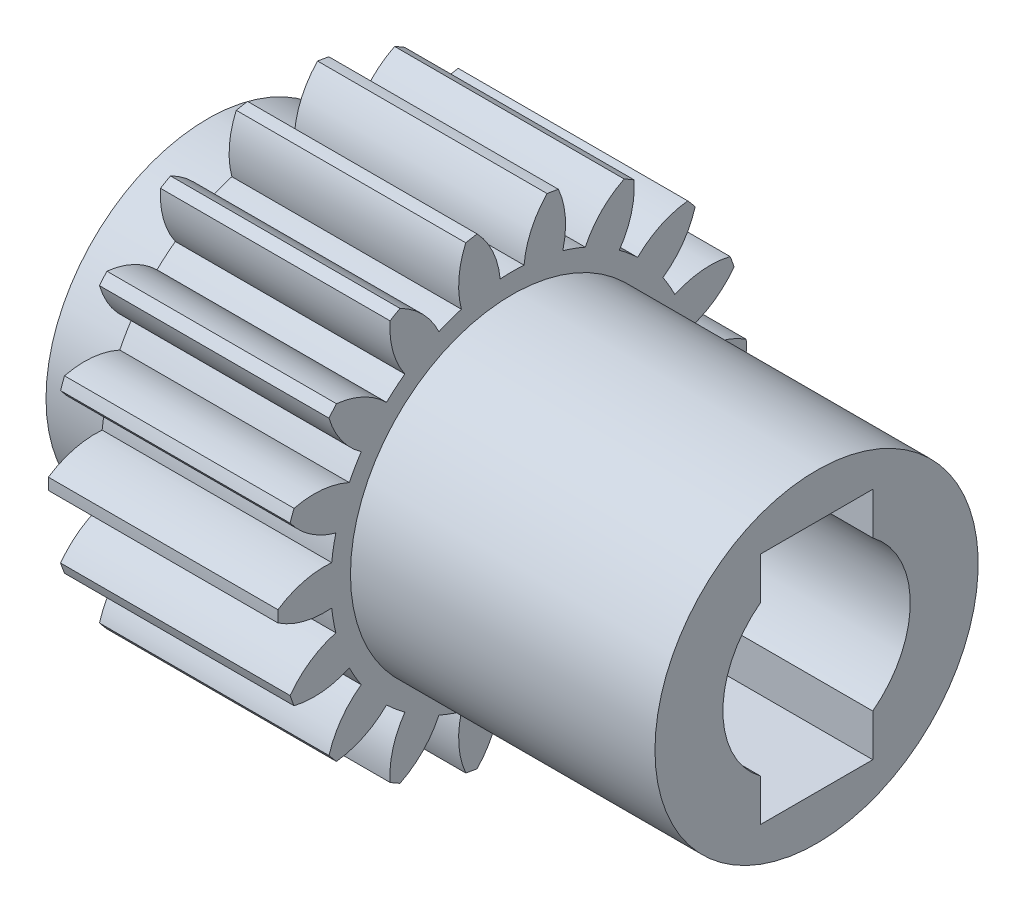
ISO-10303-21;
HEADER;
FILE_DESCRIPTION(('STEP AP214'),'2;1');
FILE_NAME('part.step','',(''),(''),'','','');
FILE_SCHEMA(('AUTOMOTIVE_DESIGN { 1 0 10303 214 1 1 1 1 }'));
ENDSEC;
DATA;
#1=APPLICATION_CONTEXT('core data for automotive mechanical design processes');
#2=APPLICATION_PROTOCOL_DEFINITION('international standard','automotive_design',2000,#1);
#3=PRODUCT_CONTEXT('',#1,'mechanical');
#4=PRODUCT('Part','Part','',(#3));
#5=PRODUCT_RELATED_PRODUCT_CATEGORY('part','',(#4));
#6=PRODUCT_DEFINITION_FORMATION('','',#4);
#7=PRODUCT_DEFINITION_CONTEXT('part definition',#1,'design');
#8=PRODUCT_DEFINITION('design','',#6,#7);
#9=PRODUCT_DEFINITION_SHAPE('','',#8);
#10=(LENGTH_UNIT() NAMED_UNIT(*) SI_UNIT(.MILLI.,.METRE.));
#11=(NAMED_UNIT(*) PLANE_ANGLE_UNIT() SI_UNIT($,.RADIAN.));
#12=(NAMED_UNIT(*) SI_UNIT($,.STERADIAN.) SOLID_ANGLE_UNIT());
#13=UNCERTAINTY_MEASURE_WITH_UNIT(LENGTH_MEASURE(1.E-05),#10,'distance_accuracy_value','');
#14=(GEOMETRIC_REPRESENTATION_CONTEXT(3) GLOBAL_UNCERTAINTY_ASSIGNED_CONTEXT((#13)) GLOBAL_UNIT_ASSIGNED_CONTEXT((#10,
#11,#12)) REPRESENTATION_CONTEXT('',''));
#15=CARTESIAN_POINT('',(0.,0.,0.));
#16=DIRECTION('',(0.,0.,1.));
#17=DIRECTION('',(1.,0.,0.));
#18=AXIS2_PLACEMENT_3D('',#15,#16,#17);
#19=CARTESIAN_POINT('',(4.9,0.,0.));
#20=DIRECTION('',(-1.,0.,0.));
#21=DIRECTION('',(0.,0.,1.));
#22=AXIS2_PLACEMENT_3D('',#19,#20,#21);
#23=PLANE('',#22);
#24=CARTESIAN_POINT('',(4.9,2.77633614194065,-3.18953877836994));
#25=DIRECTION('',(-1.,0.,0.));
#26=DIRECTION('',(0.,-0.342020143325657,-0.939692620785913));
#27=AXIS2_PLACEMENT_3D('',#24,#25,#26);
#28=CIRCLE('',#27,1.8);
#29=CARTESIAN_POINT('',(4.9,3.54514819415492,-1.56198600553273));
#30=VERTEX_POINT('',#29);
#31=CARTESIAN_POINT('',(4.9,4.39034108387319,-2.39267740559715));
#32=VERTEX_POINT('',#31);
#33=EDGE_CURVE('E607',#30,#32,#28,.T.);
#34=ORIENTED_EDGE('',*,*,#33,.F.);
#35=CARTESIAN_POINT('',(4.9,0.,0.));
#36=DIRECTION('',(-1.,0.,0.));
#37=DIRECTION('',(0.,-0.342020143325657,-0.939692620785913));
#38=AXIS2_PLACEMENT_3D('',#35,#36,#37);
#39=CIRCLE('',#38,3.874);
#40=CARTESIAN_POINT('',(4.9,3.71976632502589,-1.08222663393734));
#41=VERTEX_POINT('',#40);
#42=EDGE_CURVE('E611',#41,#30,#39,.T.);
#43=ORIENTED_EDGE('',*,*,#42,.F.);
#44=CARTESIAN_POINT('',(4.9,4.17699288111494,0.658733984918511));
#45=DIRECTION('',(-1.,0.,0.));
#46=DIRECTION('',(0.,-0.342020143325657,-0.939692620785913));
#47=AXIS2_PLACEMENT_3D('',#44,#45,#46);
#48=CIRCLE('',#47,1.8);
#49=CARTESIAN_POINT('',(4.9,4.90117978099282,-0.989159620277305));
#50=VERTEX_POINT('',#49);
#51=EDGE_CURVE('E609',#50,#41,#48,.T.);
#52=ORIENTED_EDGE('',*,*,#51,.F.);
#53=CARTESIAN_POINT('',(4.9,0.,0.));
#54=DIRECTION('',(-1.,0.,0.));
#55=DIRECTION('',(0.,0.,1.));
#56=AXIS2_PLACEMENT_3D('',#53,#54,#55);
#57=CIRCLE('',#56,5.);
#58=CARTESIAN_POINT('',(4.9,4.94391498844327,-0.746796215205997));
#59=VERTEX_POINT('',#58);
#60=EDGE_CURVE('E998',#59,#50,#57,.T.);
#61=ORIENTED_EDGE('',*,*,#60,.F.);
#62=CARTESIAN_POINT('',(4.9,3.69978909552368,-2.047623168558));
#63=DIRECTION('',(-1.,0.,0.));
#64=DIRECTION('',(0.,0.,-1.));
#65=AXIS2_PLACEMENT_3D('',#62,#63,#64);
#66=CIRCLE('',#65,1.8);
#67=CARTESIAN_POINT('',(4.9,3.86558027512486,-0.255274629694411));
#68=VERTEX_POINT('',#67);
#69=EDGE_CURVE('E976',#68,#59,#66,.T.);
#70=ORIENTED_EDGE('',*,*,#69,.F.);
#71=CARTESIAN_POINT('',(4.9,0.,0.));
#72=DIRECTION('',(-1.,0.,0.));
#73=DIRECTION('',(0.,0.,-1.));
#74=AXIS2_PLACEMENT_3D('',#71,#72,#73);
#75=CIRCLE('',#74,3.874);
#76=CARTESIAN_POINT('',(4.9,3.86558027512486,0.25527462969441));
#77=VERTEX_POINT('',#76);
#78=EDGE_CURVE('E980',#77,#68,#75,.T.);
#79=ORIENTED_EDGE('',*,*,#78,.F.);
#80=CARTESIAN_POINT('',(4.9,3.69978909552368,2.047623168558));
#81=DIRECTION('',(-1.,0.,0.));
#82=DIRECTION('',(0.,0.,-1.));
#83=AXIS2_PLACEMENT_3D('',#80,#81,#82);
#84=CIRCLE('',#83,1.8);
#85=CARTESIAN_POINT('',(4.9,4.94391498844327,0.746796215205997));
#86=VERTEX_POINT('',#85);
#87=EDGE_CURVE('E978',#86,#77,#84,.T.);
#88=ORIENTED_EDGE('',*,*,#87,.F.);
#89=CARTESIAN_POINT('',(4.9,4.90117978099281,0.989159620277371));
#90=VERTEX_POINT('',#89);
#91=EDGE_CURVE('E996',#90,#86,#57,.T.);
#92=ORIENTED_EDGE('',*,*,#91,.F.);
#93=CARTESIAN_POINT('',(4.9,4.17699288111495,-0.658733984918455));
#94=DIRECTION('',(-1.,0.,0.));
#95=DIRECTION('',(0.,0.342020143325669,-0.939692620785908));
#96=AXIS2_PLACEMENT_3D('',#93,#94,#95);
#97=CIRCLE('',#96,1.8);
#98=CARTESIAN_POINT('',(4.9,3.71976632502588,1.08222663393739));
#99=VERTEX_POINT('',#98);
#100=EDGE_CURVE('E954',#99,#90,#97,.T.);
#101=ORIENTED_EDGE('',*,*,#100,.F.);
#102=CARTESIAN_POINT('',(4.9,0.,0.));
#103=DIRECTION('',(-1.,0.,0.));
#104=DIRECTION('',(0.,0.342020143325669,-0.939692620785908));
#105=AXIS2_PLACEMENT_3D('',#102,#103,#104);
#106=CIRCLE('',#105,3.874);
#107=CARTESIAN_POINT('',(4.9,3.5451481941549,1.56198600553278));
#108=VERTEX_POINT('',#107);
#109=EDGE_CURVE('E958',#108,#99,#106,.T.);
#110=ORIENTED_EDGE('',*,*,#109,.F.);
#111=CARTESIAN_POINT('',(4.9,2.77633614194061,3.18953877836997));
#112=DIRECTION('',(-1.,0.,0.));
#113=DIRECTION('',(0.,0.342020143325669,-0.939692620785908));
#114=AXIS2_PLACEMENT_3D('',#111,#112,#113);
#115=CIRCLE('',#114,1.8);
#116=CARTESIAN_POINT('',(4.9,4.39034108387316,2.39267740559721));
#117=VERTEX_POINT('',#116);
#118=EDGE_CURVE('E956',#117,#108,#115,.T.);
#119=ORIENTED_EDGE('',*,*,#118,.F.);
#120=CARTESIAN_POINT('',(4.9,4.2672899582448,2.60580820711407));
#121=VERTEX_POINT('',#120);
#122=EDGE_CURVE('E1103',#121,#117,#57,.T.);
#123=ORIENTED_EDGE('',*,*,#122,.F.);
#124=CARTESIAN_POINT('',(4.9,4.15038967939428,0.809608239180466));
#125=DIRECTION('',(-1.,0.,0.));
#126=DIRECTION('',(0.,0.642787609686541,-0.766044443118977));
#127=AXIS2_PLACEMENT_3D('',#124,#125,#126);
#128=CIRCLE('',#127,1.8);
#129=CARTESIAN_POINT('',(4.9,3.12529365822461,2.28919539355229));
#130=VERTEX_POINT('',#129);
#131=EDGE_CURVE('E932',#130,#121,#128,.T.);
#132=ORIENTED_EDGE('',*,*,#131,.F.);
#133=CARTESIAN_POINT('',(4.9,0.,0.));
#134=DIRECTION('',(-1.,0.,0.));
#135=DIRECTION('',(0.,0.642787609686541,-0.766044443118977));
#136=AXIS2_PLACEMENT_3D('',#133,#134,#135);
#137=CIRCLE('',#136,3.874);
#138=CARTESIAN_POINT('',(4.9,2.79711892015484,2.6802988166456));
#139=VERTEX_POINT('',#138);
#140=EDGE_CURVE('E936',#139,#130,#137,.T.);
#141=ORIENTED_EDGE('',*,*,#140,.F.);
#142=CARTESIAN_POINT('',(4.9,1.51801607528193,3.94674893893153));
#143=DIRECTION('',(-1.,0.,0.));
#144=DIRECTION('',(0.,0.642787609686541,-0.766044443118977));
#145=AXIS2_PLACEMENT_3D('',#142,#143,#144);
#146=CIRCLE('',#145,1.8);
#147=CARTESIAN_POINT('',(4.9,3.30722725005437,3.74996638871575));
#148=VERTEX_POINT('',#147);
#149=EDGE_CURVE('E934',#148,#139,#146,.T.);
#150=ORIENTED_EDGE('',*,*,#149,.F.);
#151=CARTESIAN_POINT('',(4.9,3.11870198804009,3.90815786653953));
#152=VERTEX_POINT('',#151);
#153=EDGE_CURVE('E1104',#152,#148,#57,.T.);
#154=ORIENTED_EDGE('',*,*,#153,.F.);
#155=CARTESIAN_POINT('',(4.9,3.62318822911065,2.18029976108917));
#156=DIRECTION('',(-1.,0.,0.));
#157=DIRECTION('',(0.,0.86602540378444,-0.499999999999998));
#158=AXIS2_PLACEMENT_3D('',#155,#156,#157);
#159=CIRCLE('',#158,1.8);
#160=CARTESIAN_POINT('',(4.9,2.15386445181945,3.22005340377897));
#161=VERTEX_POINT('',#160);
#162=EDGE_CURVE('E910',#161,#152,#159,.T.);
#163=ORIENTED_EDGE('',*,*,#162,.F.);
#164=CARTESIAN_POINT('',(4.9,0.,0.));
#165=DIRECTION('',(-1.,0.,0.));
#166=DIRECTION('',(0.,0.86602540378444,-0.499999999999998));
#167=AXIS2_PLACEMENT_3D('',#164,#165,#166);
#168=CIRCLE('',#167,3.874);
#169=CARTESIAN_POINT('',(4.9,1.7117158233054,3.47532803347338));
#170=VERTEX_POINT('',#169);
#171=EDGE_CURVE('E914',#170,#161,#168,.T.);
#172=ORIENTED_EDGE('',*,*,#171,.F.);
#173=CARTESIAN_POINT('',(4.9,0.0766008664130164,4.22792292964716));
#174=DIRECTION('',(-1.,0.,0.));
#175=DIRECTION('',(0.,0.86602540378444,-0.499999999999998));
#176=AXIS2_PLACEMENT_3D('',#173,#174,#175);
#177=CIRCLE('',#176,1.8);
#178=CARTESIAN_POINT('',(4.9,1.82521300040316,4.65495408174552));
#179=VERTEX_POINT('',#178);
#180=EDGE_CURVE('E912',#179,#170,#177,.T.);
#181=ORIENTED_EDGE('',*,*,#180,.F.);
#182=CARTESIAN_POINT('',(4.9,1.59395253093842,4.73912600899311));
#183=VERTEX_POINT('',#182);
#184=EDGE_CURVE('E1108',#183,#179,#57,.T.);
#185=ORIENTED_EDGE('',*,*,#184,.F.);
#186=CARTESIAN_POINT('',(4.9,2.658976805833,3.28801495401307));
#187=DIRECTION('',(-1.,0.,0.));
#188=DIRECTION('',(0.,0.984807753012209,-0.173648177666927));
#189=AXIS2_PLACEMENT_3D('',#186,#187,#188);
#190=CIRCLE('',#189,1.8);
#191=CARTESIAN_POINT('',(4.9,0.922647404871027,3.76252545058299));
#192=VERTEX_POINT('',#191);
#193=EDGE_CURVE('E888',#192,#183,#190,.T.);
#194=ORIENTED_EDGE('',*,*,#193,.F.);
#195=CARTESIAN_POINT('',(4.9,0.,0.));
#196=DIRECTION('',(-1.,0.,0.));
#197=DIRECTION('',(0.,0.984807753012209,-0.173648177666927));
#198=AXIS2_PLACEMENT_3D('',#195,#196,#197);
#199=CIRCLE('',#198,3.874);
#200=CARTESIAN_POINT('',(4.9,0.419854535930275,3.85118139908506));
#201=VERTEX_POINT('',#200);
#202=EDGE_CURVE('E892',#201,#192,#199,.T.);
#203=ORIENTED_EDGE('',*,*,#202,.F.);
#204=CARTESIAN_POINT('',(4.9,-1.37405353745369,3.99914701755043));
#205=DIRECTION('',(-1.,0.,0.));
#206=DIRECTION('',(0.,0.984807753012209,-0.173648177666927));
#207=AXIS2_PLACEMENT_3D('',#204,#205,#206);
#208=CIRCLE('',#207,1.8);
#209=CARTESIAN_POINT('',(4.9,0.123051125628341,4.99848561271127));
#210=VERTEX_POINT('',#209);
#211=EDGE_CURVE('E890',#210,#201,#208,.T.);
#212=ORIENTED_EDGE('',*,*,#211,.F.);
#213=CARTESIAN_POINT('',(4.9,-0.123051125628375,4.99848561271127));
#214=VERTEX_POINT('',#213);
#215=EDGE_CURVE('E1113',#214,#210,#57,.T.);
#216=ORIENTED_EDGE('',*,*,#215,.F.);
#217=CARTESIAN_POINT('',(4.9,1.37405353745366,3.99914701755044));
#218=DIRECTION('',(-1.,0.,0.));
#219=DIRECTION('',(0.,0.984807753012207,0.173648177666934));
#220=AXIS2_PLACEMENT_3D('',#217,#218,#219);
#221=CIRCLE('',#220,1.8);
#222=CARTESIAN_POINT('',(4.9,-0.419854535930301,3.85118139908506));
#223=VERTEX_POINT('',#222);
#224=EDGE_CURVE('E866',#223,#214,#221,.T.);
#225=ORIENTED_EDGE('',*,*,#224,.F.);
#226=CARTESIAN_POINT('',(4.9,0.,0.));
#227=DIRECTION('',(-1.,0.,0.));
#228=DIRECTION('',(0.,0.984807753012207,0.173648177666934));
#229=AXIS2_PLACEMENT_3D('',#226,#227,#228);
#230=CIRCLE('',#229,3.874);
#231=CARTESIAN_POINT('',(4.9,-0.922647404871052,3.76252545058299));
#232=VERTEX_POINT('',#231);
#233=EDGE_CURVE('E870',#232,#223,#230,.T.);
#234=ORIENTED_EDGE('',*,*,#233,.F.);
#235=CARTESIAN_POINT('',(4.9,-2.65897680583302,3.28801495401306));
#236=DIRECTION('',(-1.,0.,0.));
#237=DIRECTION('',(0.,0.984807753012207,0.173648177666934));
#238=AXIS2_PLACEMENT_3D('',#235,#236,#237);
#239=CIRCLE('',#238,1.8);
#240=CARTESIAN_POINT('',(4.9,-1.59395253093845,4.7391260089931));
#241=VERTEX_POINT('',#240);
#242=EDGE_CURVE('E868',#241,#232,#239,.T.);
#243=ORIENTED_EDGE('',*,*,#242,.F.);
#244=CARTESIAN_POINT('',(4.9,-1.82521300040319,4.65495408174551));
#245=VERTEX_POINT('',#244);
#246=EDGE_CURVE('E1118',#245,#241,#57,.T.);
#247=ORIENTED_EDGE('',*,*,#246,.F.);
#248=CARTESIAN_POINT('',(4.9,-0.0766008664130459,4.22792292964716));
#249=DIRECTION('',(-1.,0.,0.));
#250=DIRECTION('',(0.,0.866025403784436,0.500000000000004));
#251=AXIS2_PLACEMENT_3D('',#248,#249,#250);
#252=CIRCLE('',#251,1.8);
#253=CARTESIAN_POINT('',(4.9,-1.71171582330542,3.47532803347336));
#254=VERTEX_POINT('',#253);
#255=EDGE_CURVE('E844',#254,#245,#252,.T.);
#256=ORIENTED_EDGE('',*,*,#255,.F.);
#257=CARTESIAN_POINT('',(4.9,0.,0.));
#258=DIRECTION('',(-1.,0.,0.));
#259=DIRECTION('',(0.,0.866025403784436,0.500000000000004));
#260=AXIS2_PLACEMENT_3D('',#257,#258,#259);
#261=CIRCLE('',#260,3.874);
#262=CARTESIAN_POINT('',(4.9,-2.15386445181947,3.22005340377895));
#263=VERTEX_POINT('',#262);
#264=EDGE_CURVE('E848',#263,#254,#261,.T.);
#265=ORIENTED_EDGE('',*,*,#264,.F.);
#266=CARTESIAN_POINT('',(4.9,-3.62318822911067,2.18029976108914));
#267=DIRECTION('',(-1.,0.,0.));
#268=DIRECTION('',(0.,0.866025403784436,0.500000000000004));
#269=AXIS2_PLACEMENT_3D('',#266,#267,#268);
#270=CIRCLE('',#269,1.8);
#271=CARTESIAN_POINT('',(4.9,-3.11870198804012,3.9081578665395));
#272=VERTEX_POINT('',#271);
#273=EDGE_CURVE('E846',#272,#263,#270,.T.);
#274=ORIENTED_EDGE('',*,*,#273,.F.);
#275=CARTESIAN_POINT('',(4.9,-3.30722725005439,3.74996638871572));
#276=VERTEX_POINT('',#275);
#277=EDGE_CURVE('E1123',#276,#272,#57,.T.);
#278=ORIENTED_EDGE('',*,*,#277,.F.);
#279=CARTESIAN_POINT('',(4.9,-1.51801607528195,3.94674893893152));
#280=DIRECTION('',(-1.,0.,0.));
#281=DIRECTION('',(0.,0.642787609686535,0.766044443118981));
#282=AXIS2_PLACEMENT_3D('',#279,#280,#281);
#283=CIRCLE('',#282,1.8);
#284=CARTESIAN_POINT('',(4.9,-2.79711892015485,2.68029881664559));
#285=VERTEX_POINT('',#284);
#286=EDGE_CURVE('E822',#285,#276,#283,.T.);
#287=ORIENTED_EDGE('',*,*,#286,.F.);
#288=CARTESIAN_POINT('',(4.9,0.,0.));
#289=DIRECTION('',(-1.,0.,0.));
#290=DIRECTION('',(0.,0.642787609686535,0.766044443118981));
#291=AXIS2_PLACEMENT_3D('',#288,#289,#290);
#292=CIRCLE('',#291,3.874);
#293=CARTESIAN_POINT('',(4.9,-3.12529365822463,2.28919539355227));
#294=VERTEX_POINT('',#293);
#295=EDGE_CURVE('E826',#294,#285,#292,.T.);
#296=ORIENTED_EDGE('',*,*,#295,.F.);
#297=CARTESIAN_POINT('',(4.9,-4.15038967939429,0.809608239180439));
#298=DIRECTION('',(-1.,0.,0.));
#299=DIRECTION('',(0.,0.642787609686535,0.766044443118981));
#300=AXIS2_PLACEMENT_3D('',#297,#298,#299);
#301=CIRCLE('',#300,1.8);
#302=CARTESIAN_POINT('',(4.9,-4.26728995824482,2.60580820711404));
#303=VERTEX_POINT('',#302);
#304=EDGE_CURVE('E824',#303,#294,#301,.T.);
#305=ORIENTED_EDGE('',*,*,#304,.F.);
#306=CARTESIAN_POINT('',(4.9,-4.39034108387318,2.39267740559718));
#307=VERTEX_POINT('',#306);
#308=EDGE_CURVE('E1128',#307,#303,#57,.T.);
#309=ORIENTED_EDGE('',*,*,#308,.F.);
#310=CARTESIAN_POINT('',(4.9,-2.77633614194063,3.18953877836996));
#311=DIRECTION('',(-1.,0.,0.));
#312=DIRECTION('',(0.,0.342020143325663,0.939692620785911));
#313=AXIS2_PLACEMENT_3D('',#310,#311,#312);
#314=CIRCLE('',#313,1.8);
#315=CARTESIAN_POINT('',(4.9,-3.54514819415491,1.56198600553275));
#316=VERTEX_POINT('',#315);
#317=EDGE_CURVE('E800',#316,#307,#314,.T.);
#318=ORIENTED_EDGE('',*,*,#317,.F.);
#319=CARTESIAN_POINT('',(4.9,0.,0.));
#320=DIRECTION('',(-1.,0.,0.));
#321=DIRECTION('',(0.,0.342020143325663,0.939692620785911));
#322=AXIS2_PLACEMENT_3D('',#319,#320,#321);
#323=CIRCLE('',#322,3.874);
#324=CARTESIAN_POINT('',(4.9,-3.71976632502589,1.08222663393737));
#325=VERTEX_POINT('',#324);
#326=EDGE_CURVE('E804',#325,#316,#323,.T.);
#327=ORIENTED_EDGE('',*,*,#326,.F.);
#328=CARTESIAN_POINT('',(4.9,-4.17699288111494,-0.658733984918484));
#329=DIRECTION('',(-1.,0.,0.));
#330=DIRECTION('',(0.,0.342020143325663,0.939692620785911));
#331=AXIS2_PLACEMENT_3D('',#328,#329,#330);
#332=CIRCLE('',#331,1.8);
#333=CARTESIAN_POINT('',(4.9,-4.90117978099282,0.989159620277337));
#334=VERTEX_POINT('',#333);
#335=EDGE_CURVE('E802',#334,#325,#332,.T.);
#336=ORIENTED_EDGE('',*,*,#335,.F.);
#337=CARTESIAN_POINT('',(4.9,-4.94391498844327,0.746796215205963));
#338=VERTEX_POINT('',#337);
#339=EDGE_CURVE('E1133',#338,#334,#57,.T.);
#340=ORIENTED_EDGE('',*,*,#339,.F.);
#341=CARTESIAN_POINT('',(4.9,-3.6997890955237,2.04762316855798));
#342=DIRECTION('',(-1.,0.,0.));
#343=DIRECTION('',(0.,0.,1.));
#344=AXIS2_PLACEMENT_3D('',#341,#342,#343);
#345=CIRCLE('',#344,1.8);
#346=CARTESIAN_POINT('',(4.9,-3.86558027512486,0.255274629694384));
#347=VERTEX_POINT('',#346);
#348=EDGE_CURVE('E778',#347,#338,#345,.T.);
#349=ORIENTED_EDGE('',*,*,#348,.F.);
#350=CARTESIAN_POINT('',(4.9,0.,0.));
#351=DIRECTION('',(-1.,0.,0.));
#352=DIRECTION('',(0.,0.,1.));
#353=AXIS2_PLACEMENT_3D('',#350,#351,#352);
#354=CIRCLE('',#353,3.874);
#355=CARTESIAN_POINT('',(4.9,-3.86558027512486,-0.255274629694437));
#356=VERTEX_POINT('',#355);
#357=EDGE_CURVE('E782',#356,#347,#354,.T.);
#358=ORIENTED_EDGE('',*,*,#357,.F.);
#359=CARTESIAN_POINT('',(4.9,-3.69978909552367,-2.04762316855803));
#360=DIRECTION('',(-1.,0.,0.));
#361=DIRECTION('',(0.,0.,1.));
#362=AXIS2_PLACEMENT_3D('',#359,#360,#361);
#363=CIRCLE('',#362,1.8);
#364=CARTESIAN_POINT('',(4.9,-4.94391498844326,-0.746796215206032));
#365=VERTEX_POINT('',#364);
#366=EDGE_CURVE('E780',#365,#356,#363,.T.);
#367=ORIENTED_EDGE('',*,*,#366,.F.);
#368=CARTESIAN_POINT('',(4.9,-4.9011797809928,-0.989159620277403));
#369=VERTEX_POINT('',#368);
#370=EDGE_CURVE('E1138',#369,#365,#57,.T.);
#371=ORIENTED_EDGE('',*,*,#370,.F.);
#372=CARTESIAN_POINT('',(4.9,-4.17699288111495,0.658733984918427));
#373=DIRECTION('',(-1.,0.,0.));
#374=DIRECTION('',(0.,-0.342020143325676,0.939692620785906));
#375=AXIS2_PLACEMENT_3D('',#372,#373,#374);
#376=CIRCLE('',#375,1.8);
#377=CARTESIAN_POINT('',(4.9,-3.71976632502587,-1.08222663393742));
#378=VERTEX_POINT('',#377);
#379=EDGE_CURVE('E756',#378,#369,#376,.T.);
#380=ORIENTED_EDGE('',*,*,#379,.F.);
#381=CARTESIAN_POINT('',(4.9,0.,0.));
#382=DIRECTION('',(-1.,0.,0.));
#383=DIRECTION('',(0.,-0.342020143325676,0.939692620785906));
#384=AXIS2_PLACEMENT_3D('',#381,#382,#383);
#385=CIRCLE('',#384,3.874);
#386=CARTESIAN_POINT('',(4.9,-3.54514819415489,-1.5619860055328));
#387=VERTEX_POINT('',#386);
#388=EDGE_CURVE('E760',#387,#378,#385,.T.);
#389=ORIENTED_EDGE('',*,*,#388,.F.);
#390=CARTESIAN_POINT('',(4.9,-2.77633614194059,-3.18953877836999));
#391=DIRECTION('',(-1.,0.,0.));
#392=DIRECTION('',(0.,-0.342020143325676,0.939692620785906));
#393=AXIS2_PLACEMENT_3D('',#390,#391,#392);
#394=CIRCLE('',#393,1.8);
#395=CARTESIAN_POINT('',(4.9,-4.39034108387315,-2.39267740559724));
#396=VERTEX_POINT('',#395);
#397=EDGE_CURVE('E758',#396,#387,#394,.T.);
#398=ORIENTED_EDGE('',*,*,#397,.F.);
#399=CARTESIAN_POINT('',(4.9,-4.26728995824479,-2.6058082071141));
#400=VERTEX_POINT('',#399);
#401=EDGE_CURVE('E1143',#400,#396,#57,.T.);
#402=ORIENTED_EDGE('',*,*,#401,.F.);
#403=CARTESIAN_POINT('',(4.9,-4.15038967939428,-0.809608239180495));
#404=DIRECTION('',(-1.,0.,0.));
#405=DIRECTION('',(0.,-0.642787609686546,0.766044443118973));
#406=AXIS2_PLACEMENT_3D('',#403,#404,#405);
#407=CIRCLE('',#406,1.8);
#408=CARTESIAN_POINT('',(4.9,-3.12529365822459,-2.28919539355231));
#409=VERTEX_POINT('',#408);
#410=EDGE_CURVE('E734',#409,#400,#407,.T.);
#411=ORIENTED_EDGE('',*,*,#410,.F.);
#412=CARTESIAN_POINT('',(4.9,0.,0.));
#413=DIRECTION('',(-1.,0.,0.));
#414=DIRECTION('',(0.,-0.642787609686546,0.766044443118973));
#415=AXIS2_PLACEMENT_3D('',#412,#413,#414);
#416=CIRCLE('',#415,3.874);
#417=CARTESIAN_POINT('',(4.9,-2.79711892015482,-2.68029881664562));
#418=VERTEX_POINT('',#417);
#419=EDGE_CURVE('E738',#418,#409,#416,.T.);
#420=ORIENTED_EDGE('',*,*,#419,.F.);
#421=CARTESIAN_POINT('',(4.9,-1.5180160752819,-3.94674893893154));
#422=DIRECTION('',(-1.,0.,0.));
#423=DIRECTION('',(0.,-0.642787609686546,0.766044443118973));
#424=AXIS2_PLACEMENT_3D('',#421,#422,#423);
#425=CIRCLE('',#424,1.8);
#426=CARTESIAN_POINT('',(4.9,-3.30722725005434,-3.74996638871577));
#427=VERTEX_POINT('',#426);
#428=EDGE_CURVE('E736',#427,#418,#425,.T.);
#429=ORIENTED_EDGE('',*,*,#428,.F.);
#430=CARTESIAN_POINT('',(4.9,-3.11870198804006,-3.90815786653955));
#431=VERTEX_POINT('',#430);
#432=EDGE_CURVE('E1148',#431,#427,#57,.T.);
#433=ORIENTED_EDGE('',*,*,#432,.F.);
#434=CARTESIAN_POINT('',(4.9,-3.62318822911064,-2.18029976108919));
#435=DIRECTION('',(-1.,0.,0.));
#436=DIRECTION('',(0.,-0.866025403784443,0.499999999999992));
#437=AXIS2_PLACEMENT_3D('',#434,#435,#436);
#438=CIRCLE('',#437,1.8);
#439=CARTESIAN_POINT('',(4.9,-2.15386445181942,-3.22005340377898));
#440=VERTEX_POINT('',#439);
#441=EDGE_CURVE('E712',#440,#431,#438,.T.);
#442=ORIENTED_EDGE('',*,*,#441,.F.);
#443=CARTESIAN_POINT('',(4.9,0.,0.));
#444=DIRECTION('',(-1.,0.,0.));
#445=DIRECTION('',(0.,-0.866025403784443,0.499999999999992));
#446=AXIS2_PLACEMENT_3D('',#443,#444,#445);
#447=CIRCLE('',#446,3.874);
#448=CARTESIAN_POINT('',(4.9,-1.71171582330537,-3.47532803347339));
#449=VERTEX_POINT('',#448);
#450=EDGE_CURVE('E716',#449,#440,#447,.T.);
#451=ORIENTED_EDGE('',*,*,#450,.F.);
#452=CARTESIAN_POINT('',(4.9,-0.0766008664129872,-4.22792292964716));
#453=DIRECTION('',(-1.,0.,0.));
#454=DIRECTION('',(0.,-0.866025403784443,0.499999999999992));
#455=AXIS2_PLACEMENT_3D('',#452,#453,#454);
#456=CIRCLE('',#455,1.8);
#457=CARTESIAN_POINT('',(4.9,-1.82521300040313,-4.65495408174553));
#458=VERTEX_POINT('',#457);
#459=EDGE_CURVE('E714',#458,#449,#456,.T.);
#460=ORIENTED_EDGE('',*,*,#459,.F.);
#461=CARTESIAN_POINT('',(4.9,-1.59395253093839,-4.73912600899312));
#462=VERTEX_POINT('',#461);
#463=EDGE_CURVE('E1153',#462,#458,#57,.T.);
#464=ORIENTED_EDGE('',*,*,#463,.F.);
#465=CARTESIAN_POINT('',(4.9,-2.65897680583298,-3.28801495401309));
#466=DIRECTION('',(-1.,0.,0.));
#467=DIRECTION('',(0.,-0.98480775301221,0.173648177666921));
#468=AXIS2_PLACEMENT_3D('',#465,#466,#467);
#469=CIRCLE('',#468,1.8);
#470=CARTESIAN_POINT('',(4.9,-0.922647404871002,-3.762525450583));
#471=VERTEX_POINT('',#470);
#472=EDGE_CURVE('E690',#471,#462,#469,.T.);
#473=ORIENTED_EDGE('',*,*,#472,.F.);
#474=CARTESIAN_POINT('',(4.9,0.,0.));
#475=DIRECTION('',(-1.,0.,0.));
#476=DIRECTION('',(0.,-0.98480775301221,0.173648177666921));
#477=AXIS2_PLACEMENT_3D('',#474,#475,#476);
#478=CIRCLE('',#477,3.874);
#479=CARTESIAN_POINT('',(4.9,-0.419854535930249,-3.85118139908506));
#480=VERTEX_POINT('',#479);
#481=EDGE_CURVE('E694',#480,#471,#478,.T.);
#482=ORIENTED_EDGE('',*,*,#481,.F.);
#483=CARTESIAN_POINT('',(4.9,1.37405353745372,-3.99914701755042));
#484=DIRECTION('',(-1.,0.,0.));
#485=DIRECTION('',(0.,-0.98480775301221,0.173648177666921));
#486=AXIS2_PLACEMENT_3D('',#483,#484,#485);
#487=CIRCLE('',#486,1.8);
#488=CARTESIAN_POINT('',(4.9,-0.123051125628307,-4.99848561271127));
#489=VERTEX_POINT('',#488);
#490=EDGE_CURVE('E692',#489,#480,#487,.T.);
#491=ORIENTED_EDGE('',*,*,#490,.F.);
#492=CARTESIAN_POINT('',(4.9,0.123051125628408,-4.99848561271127));
#493=VERTEX_POINT('',#492);
#494=EDGE_CURVE('E1158',#493,#489,#57,.T.);
#495=ORIENTED_EDGE('',*,*,#494,.F.);
#496=CARTESIAN_POINT('',(4.9,-1.37405353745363,-3.99914701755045));
#497=DIRECTION('',(-1.,0.,0.));
#498=DIRECTION('',(0.,-0.984807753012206,-0.17364817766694));
#499=AXIS2_PLACEMENT_3D('',#496,#497,#498);
#500=CIRCLE('',#499,1.8);
#501=CARTESIAN_POINT('',(4.9,0.419854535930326,-3.85118139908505));
#502=VERTEX_POINT('',#501);
#503=EDGE_CURVE('E668',#502,#493,#500,.T.);
#504=ORIENTED_EDGE('',*,*,#503,.F.);
#505=CARTESIAN_POINT('',(4.9,0.,0.));
#506=DIRECTION('',(-1.,0.,0.));
#507=DIRECTION('',(0.,-0.984807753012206,-0.17364817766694));
#508=AXIS2_PLACEMENT_3D('',#505,#506,#507);
#509=CIRCLE('',#508,3.874);
#510=CARTESIAN_POINT('',(4.9,0.922647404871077,-3.76252545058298));
#511=VERTEX_POINT('',#510);
#512=EDGE_CURVE('E672',#511,#502,#509,.T.);
#513=ORIENTED_EDGE('',*,*,#512,.F.);
#514=CARTESIAN_POINT('',(4.9,2.65897680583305,-3.28801495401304));
#515=DIRECTION('',(-1.,0.,0.));
#516=DIRECTION('',(0.,-0.984807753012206,-0.17364817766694));
#517=AXIS2_PLACEMENT_3D('',#514,#515,#516);
#518=CIRCLE('',#517,1.8);
#519=CARTESIAN_POINT('',(4.9,1.59395253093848,-4.73912600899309));
#520=VERTEX_POINT('',#519);
#521=EDGE_CURVE('E670',#520,#511,#518,.T.);
#522=ORIENTED_EDGE('',*,*,#521,.F.);
#523=CARTESIAN_POINT('',(4.9,1.82521300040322,-4.65495408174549));
#524=VERTEX_POINT('',#523);
#525=EDGE_CURVE('E1163',#524,#520,#57,.T.);
#526=ORIENTED_EDGE('',*,*,#525,.F.);
#527=CARTESIAN_POINT('',(4.9,0.0766008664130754,-4.22792292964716));
#528=DIRECTION('',(-1.,0.,0.));
#529=DIRECTION('',(0.,-0.866025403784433,-0.50000000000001));
#530=AXIS2_PLACEMENT_3D('',#527,#528,#529);
#531=CIRCLE('',#530,1.8);
#532=CARTESIAN_POINT('',(4.9,1.71171582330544,-3.47532803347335));
#533=VERTEX_POINT('',#532);
#534=EDGE_CURVE('E646',#533,#524,#531,.T.);
#535=ORIENTED_EDGE('',*,*,#534,.F.);
#536=CARTESIAN_POINT('',(4.9,0.,0.));
#537=DIRECTION('',(-1.,0.,0.));
#538=DIRECTION('',(0.,-0.866025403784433,-0.50000000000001));
#539=AXIS2_PLACEMENT_3D('',#536,#537,#538);
#540=CIRCLE('',#539,3.874);
#541=CARTESIAN_POINT('',(4.9,2.15386445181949,-3.22005340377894));
#542=VERTEX_POINT('',#541);
#543=EDGE_CURVE('E650',#542,#533,#540,.T.);
#544=ORIENTED_EDGE('',*,*,#543,.F.);
#545=CARTESIAN_POINT('',(4.9,3.62318822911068,-2.18029976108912));
#546=DIRECTION('',(-1.,0.,0.));
#547=DIRECTION('',(0.,-0.866025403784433,-0.50000000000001));
#548=AXIS2_PLACEMENT_3D('',#545,#546,#547);
#549=CIRCLE('',#548,1.8);
#550=CARTESIAN_POINT('',(4.9,3.11870198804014,-3.90815786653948));
#551=VERTEX_POINT('',#550);
#552=EDGE_CURVE('E648',#551,#542,#549,.T.);
#553=ORIENTED_EDGE('',*,*,#552,.F.);
#554=CARTESIAN_POINT('',(4.9,3.30722725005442,-3.7499663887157));
#555=VERTEX_POINT('',#554);
#556=EDGE_CURVE('E1168',#555,#551,#57,.T.);
#557=ORIENTED_EDGE('',*,*,#556,.F.);
#558=CARTESIAN_POINT('',(4.9,1.51801607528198,-3.94674893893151));
#559=DIRECTION('',(-1.,0.,0.));
#560=DIRECTION('',(0.,-0.64278760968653,-0.766044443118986));
#561=AXIS2_PLACEMENT_3D('',#558,#559,#560);
#562=CIRCLE('',#561,1.8);
#563=CARTESIAN_POINT('',(4.9,2.79711892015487,-2.68029881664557));
#564=VERTEX_POINT('',#563);
#565=EDGE_CURVE('E625',#564,#555,#562,.T.);
#566=ORIENTED_EDGE('',*,*,#565,.F.);
#567=CARTESIAN_POINT('',(4.9,0.,0.));
#568=DIRECTION('',(-1.,0.,0.));
#569=DIRECTION('',(0.,-0.64278760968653,-0.766044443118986));
#570=AXIS2_PLACEMENT_3D('',#567,#568,#569);
#571=CIRCLE('',#570,3.874);
#572=CARTESIAN_POINT('',(4.9,3.12529365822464,-2.28919539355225));
#573=VERTEX_POINT('',#572);
#574=EDGE_CURVE('E629',#573,#564,#571,.T.);
#575=ORIENTED_EDGE('',*,*,#574,.F.);
#576=CARTESIAN_POINT('',(4.9,4.1503896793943,-0.809608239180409));
#577=DIRECTION('',(-1.,0.,0.));
#578=DIRECTION('',(0.,-0.64278760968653,-0.766044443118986));
#579=AXIS2_PLACEMENT_3D('',#576,#577,#578);
#580=CIRCLE('',#579,1.8);
#581=CARTESIAN_POINT('',(4.9,4.26728995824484,-2.60580820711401));
#582=VERTEX_POINT('',#581);
#583=EDGE_CURVE('E627',#582,#573,#580,.T.);
#584=ORIENTED_EDGE('',*,*,#583,.F.);
#585=EDGE_CURVE('E1002',#32,#582,#57,.T.);
#586=ORIENTED_EDGE('',*,*,#585,.F.);
#587=EDGE_LOOP('',(#34,#43,#52,#61,#70,#79,#88,#92,#101,#110,#119,#123,#132,#141,#150,#154,#163,
#172,#181,#185,#194,#203,#212,#216,#225,#234,#243,#247,#256,#265,#274,#278,#287,#296,#305,#309,
#318,#327,#336,#340,#349,#358,#367,#371,#380,#389,#398,#402,#411,#420,#429,#433,#442,#451,#460,
#464,#473,#482,#491,#495,#504,#513,#522,#526,#535,#544,#553,#557,#566,#575,#584,#586));
#588=FACE_BOUND('',#587,.T.);
#589=CARTESIAN_POINT('',(4.9,0.,0.));
#590=DIRECTION('',(-1.,0.,0.));
#591=DIRECTION('',(0.,0.,1.));
#592=AXIS2_PLACEMENT_3D('',#589,#590,#591);
#593=CIRCLE('',#592,3.45);
#594=CARTESIAN_POINT('',(4.9,0.,3.45));
#595=VERTEX_POINT('',#594);
#596=EDGE_CURVE('E11',#595,#595,#593,.F.);
#597=ORIENTED_EDGE('',*,*,#596,.F.);
#598=EDGE_LOOP('',(#597));
#599=FACE_BOUND('',#598,.T.);
#600=ADVANCED_FACE('F27',(#588,#599),#23,.F.);
#601=CARTESIAN_POINT('',(0.,0.,0.));
#602=DIRECTION('',(1.,0.,0.));
#603=DIRECTION('',(0.,0.,-1.));
#604=AXIS2_PLACEMENT_3D('',#601,#602,#603);
#605=PLANE('',#604);
#606=CARTESIAN_POINT('',(0.,2.77633614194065,-3.18953877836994));
#607=DIRECTION('',(-1.,0.,0.));
#608=DIRECTION('',(0.,-0.342020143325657,-0.939692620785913));
#609=AXIS2_PLACEMENT_3D('',#606,#607,#608);
#610=CIRCLE('',#609,1.8);
#611=CARTESIAN_POINT('',(0.,3.54514819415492,-1.56198600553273));
#612=VERTEX_POINT('',#611);
#613=CARTESIAN_POINT('',(0.,4.39034108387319,-2.39267740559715));
#614=VERTEX_POINT('',#613);
#615=EDGE_CURVE('E42',#612,#614,#610,.T.);
#616=ORIENTED_EDGE('',*,*,#615,.T.);
#617=CARTESIAN_POINT('',(0.,0.,0.));
#618=DIRECTION('',(-1.,0.,0.));
#619=DIRECTION('',(0.,0.,1.));
#620=AXIS2_PLACEMENT_3D('',#617,#618,#619);
#621=CIRCLE('',#620,5.);
#622=CARTESIAN_POINT('',(0.,4.26728995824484,-2.60580820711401));
#623=VERTEX_POINT('',#622);
#624=EDGE_CURVE('E997',#614,#623,#621,.T.);
#625=ORIENTED_EDGE('',*,*,#624,.T.);
#626=CARTESIAN_POINT('',(0.,4.1503896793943,-0.809608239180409));
#627=DIRECTION('',(1.,0.,0.));
#628=DIRECTION('',(0.,0.,-1.));
#629=AXIS2_PLACEMENT_3D('',#626,#627,#628);
#630=CIRCLE('',#629,1.8);
#631=CARTESIAN_POINT('',(0.,3.12529365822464,-2.28919539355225));
#632=VERTEX_POINT('',#631);
#633=EDGE_CURVE('E1050',#632,#623,#630,.T.);
#634=ORIENTED_EDGE('',*,*,#633,.F.);
#635=CARTESIAN_POINT('',(0.,0.,0.));
#636=DIRECTION('',(-1.,0.,0.));
#637=DIRECTION('',(0.,-0.64278760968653,-0.766044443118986));
#638=AXIS2_PLACEMENT_3D('',#635,#636,#637);
#639=CIRCLE('',#638,3.874);
#640=CARTESIAN_POINT('',(0.,2.79711892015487,-2.68029881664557));
#641=VERTEX_POINT('',#640);
#642=EDGE_CURVE('E622',#632,#641,#639,.T.);
#643=ORIENTED_EDGE('',*,*,#642,.T.);
#644=CARTESIAN_POINT('',(0.,1.51801607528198,-3.94674893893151));
#645=DIRECTION('',(-1.,0.,0.));
#646=DIRECTION('',(0.,-0.64278760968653,-0.766044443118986));
#647=AXIS2_PLACEMENT_3D('',#644,#645,#646);
#648=CIRCLE('',#647,1.8);
#649=CARTESIAN_POINT('',(0.,3.30722725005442,-3.7499663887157));
#650=VERTEX_POINT('',#649);
#651=EDGE_CURVE('E50',#641,#650,#648,.T.);
#652=ORIENTED_EDGE('',*,*,#651,.T.);
#653=CARTESIAN_POINT('',(0.,3.11870198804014,-3.90815786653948));
#654=VERTEX_POINT('',#653);
#655=EDGE_CURVE('E1194',#650,#654,#621,.T.);
#656=ORIENTED_EDGE('',*,*,#655,.T.);
#657=CARTESIAN_POINT('',(0.,3.62318822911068,-2.18029976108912));
#658=DIRECTION('',(1.,0.,0.));
#659=DIRECTION('',(0.,0.,-1.));
#660=AXIS2_PLACEMENT_3D('',#657,#658,#659);
#661=CIRCLE('',#660,1.8);
#662=CARTESIAN_POINT('',(0.,2.15386445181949,-3.22005340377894));
#663=VERTEX_POINT('',#662);
#664=EDGE_CURVE('E1047',#663,#654,#661,.T.);
#665=ORIENTED_EDGE('',*,*,#664,.F.);
#666=CARTESIAN_POINT('',(0.,0.,0.));
#667=DIRECTION('',(-1.,0.,0.));
#668=DIRECTION('',(0.,-0.866025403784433,-0.50000000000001));
#669=AXIS2_PLACEMENT_3D('',#666,#667,#668);
#670=CIRCLE('',#669,3.874);
#671=CARTESIAN_POINT('',(0.,1.71171582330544,-3.47532803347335));
#672=VERTEX_POINT('',#671);
#673=EDGE_CURVE('E643',#663,#672,#670,.T.);
#674=ORIENTED_EDGE('',*,*,#673,.T.);
#675=CARTESIAN_POINT('',(0.,0.0766008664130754,-4.22792292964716));
#676=DIRECTION('',(-1.,0.,0.));
#677=DIRECTION('',(0.,-0.866025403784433,-0.50000000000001));
#678=AXIS2_PLACEMENT_3D('',#675,#676,#677);
#679=CIRCLE('',#678,1.8);
#680=CARTESIAN_POINT('',(0.,1.82521300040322,-4.65495408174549));
#681=VERTEX_POINT('',#680);
#682=EDGE_CURVE('E640',#672,#681,#679,.T.);
#683=ORIENTED_EDGE('',*,*,#682,.T.);
#684=CARTESIAN_POINT('',(0.,1.59395253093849,-4.73912600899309));
#685=VERTEX_POINT('',#684);
#686=EDGE_CURVE('E1206',#681,#685,#621,.T.);
#687=ORIENTED_EDGE('',*,*,#686,.T.);
#688=CARTESIAN_POINT('',(0.,2.65897680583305,-3.28801495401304));
#689=DIRECTION('',(1.,0.,0.));
#690=DIRECTION('',(0.,0.,-1.));
#691=AXIS2_PLACEMENT_3D('',#688,#689,#690);
#692=CIRCLE('',#691,1.8);
#693=CARTESIAN_POINT('',(0.,0.922647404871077,-3.76252545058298));
#694=VERTEX_POINT('',#693);
#695=EDGE_CURVE('E1044',#694,#685,#692,.T.);
#696=ORIENTED_EDGE('',*,*,#695,.F.);
#697=CARTESIAN_POINT('',(0.,0.,0.));
#698=DIRECTION('',(-1.,0.,0.));
#699=DIRECTION('',(0.,-0.984807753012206,-0.17364817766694));
#700=AXIS2_PLACEMENT_3D('',#697,#698,#699);
#701=CIRCLE('',#700,3.874);
#702=CARTESIAN_POINT('',(0.,0.419854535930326,-3.85118139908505));
#703=VERTEX_POINT('',#702);
#704=EDGE_CURVE('E665',#694,#703,#701,.T.);
#705=ORIENTED_EDGE('',*,*,#704,.T.);
#706=CARTESIAN_POINT('',(0.,-1.37405353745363,-3.99914701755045));
#707=DIRECTION('',(-1.,0.,0.));
#708=DIRECTION('',(0.,-0.984807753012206,-0.17364817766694));
#709=AXIS2_PLACEMENT_3D('',#706,#707,#708);
#710=CIRCLE('',#709,1.8);
#711=CARTESIAN_POINT('',(0.,0.123051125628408,-4.99848561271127));
#712=VERTEX_POINT('',#711);
#713=EDGE_CURVE('E662',#703,#712,#710,.T.);
#714=ORIENTED_EDGE('',*,*,#713,.T.);
#715=CARTESIAN_POINT('',(0.,-0.123051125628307,-4.99848561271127));
#716=VERTEX_POINT('',#715);
#717=EDGE_CURVE('E1207',#712,#716,#621,.T.);
#718=ORIENTED_EDGE('',*,*,#717,.T.);
#719=CARTESIAN_POINT('',(0.,1.37405353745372,-3.99914701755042));
#720=DIRECTION('',(1.,0.,0.));
#721=DIRECTION('',(0.,0.,-1.));
#722=AXIS2_PLACEMENT_3D('',#719,#720,#721);
#723=CIRCLE('',#722,1.8);
#724=CARTESIAN_POINT('',(0.,-0.419854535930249,-3.85118139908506));
#725=VERTEX_POINT('',#724);
#726=EDGE_CURVE('E1041',#725,#716,#723,.T.);
#727=ORIENTED_EDGE('',*,*,#726,.F.);
#728=CARTESIAN_POINT('',(0.,0.,0.));
#729=DIRECTION('',(-1.,0.,0.));
#730=DIRECTION('',(0.,-0.98480775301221,0.173648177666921));
#731=AXIS2_PLACEMENT_3D('',#728,#729,#730);
#732=CIRCLE('',#731,3.874);
#733=CARTESIAN_POINT('',(0.,-0.922647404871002,-3.762525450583));
#734=VERTEX_POINT('',#733);
#735=EDGE_CURVE('E687',#725,#734,#732,.T.);
#736=ORIENTED_EDGE('',*,*,#735,.T.);
#737=CARTESIAN_POINT('',(0.,-2.65897680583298,-3.28801495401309));
#738=DIRECTION('',(-1.,0.,0.));
#739=DIRECTION('',(0.,-0.98480775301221,0.173648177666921));
#740=AXIS2_PLACEMENT_3D('',#737,#738,#739);
#741=CIRCLE('',#740,1.8);
#742=CARTESIAN_POINT('',(0.,-1.59395253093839,-4.73912600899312));
#743=VERTEX_POINT('',#742);
#744=EDGE_CURVE('E684',#734,#743,#741,.T.);
#745=ORIENTED_EDGE('',*,*,#744,.T.);
#746=CARTESIAN_POINT('',(0.,-1.82521300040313,-4.65495408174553));
#747=VERTEX_POINT('',#746);
#748=EDGE_CURVE('E1210',#743,#747,#621,.T.);
#749=ORIENTED_EDGE('',*,*,#748,.T.);
#750=CARTESIAN_POINT('',(0.,-0.0766008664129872,-4.22792292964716));
#751=DIRECTION('',(1.,0.,0.));
#752=DIRECTION('',(0.,0.,-1.));
#753=AXIS2_PLACEMENT_3D('',#750,#751,#752);
#754=CIRCLE('',#753,1.8);
#755=CARTESIAN_POINT('',(0.,-1.71171582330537,-3.47532803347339));
#756=VERTEX_POINT('',#755);
#757=EDGE_CURVE('E1038',#756,#747,#754,.T.);
#758=ORIENTED_EDGE('',*,*,#757,.F.);
#759=CARTESIAN_POINT('',(0.,0.,0.));
#760=DIRECTION('',(-1.,0.,0.));
#761=DIRECTION('',(0.,-0.866025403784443,0.499999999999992));
#762=AXIS2_PLACEMENT_3D('',#759,#760,#761);
#763=CIRCLE('',#762,3.874);
#764=CARTESIAN_POINT('',(0.,-2.15386445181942,-3.22005340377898));
#765=VERTEX_POINT('',#764);
#766=EDGE_CURVE('E709',#756,#765,#763,.T.);
#767=ORIENTED_EDGE('',*,*,#766,.T.);
#768=CARTESIAN_POINT('',(0.,-3.62318822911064,-2.18029976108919));
#769=DIRECTION('',(-1.,0.,0.));
#770=DIRECTION('',(0.,-0.866025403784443,0.499999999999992));
#771=AXIS2_PLACEMENT_3D('',#768,#769,#770);
#772=CIRCLE('',#771,1.8);
#773=CARTESIAN_POINT('',(0.,-3.11870198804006,-3.90815786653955));
#774=VERTEX_POINT('',#773);
#775=EDGE_CURVE('E706',#765,#774,#772,.T.);
#776=ORIENTED_EDGE('',*,*,#775,.T.);
#777=CARTESIAN_POINT('',(0.,-3.30722725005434,-3.74996638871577));
#778=VERTEX_POINT('',#777);
#779=EDGE_CURVE('E1213',#774,#778,#621,.T.);
#780=ORIENTED_EDGE('',*,*,#779,.T.);
#781=CARTESIAN_POINT('',(0.,-1.5180160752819,-3.94674893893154));
#782=DIRECTION('',(1.,0.,0.));
#783=DIRECTION('',(0.,0.,-1.));
#784=AXIS2_PLACEMENT_3D('',#781,#782,#783);
#785=CIRCLE('',#784,1.8);
#786=CARTESIAN_POINT('',(0.,-2.79711892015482,-2.68029881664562));
#787=VERTEX_POINT('',#786);
#788=EDGE_CURVE('E1035',#787,#778,#785,.T.);
#789=ORIENTED_EDGE('',*,*,#788,.F.);
#790=CARTESIAN_POINT('',(0.,0.,0.));
#791=DIRECTION('',(-1.,0.,0.));
#792=DIRECTION('',(0.,-0.642787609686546,0.766044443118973));
#793=AXIS2_PLACEMENT_3D('',#790,#791,#792);
#794=CIRCLE('',#793,3.874);
#795=CARTESIAN_POINT('',(0.,-3.12529365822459,-2.28919539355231));
#796=VERTEX_POINT('',#795);
#797=EDGE_CURVE('E731',#787,#796,#794,.T.);
#798=ORIENTED_EDGE('',*,*,#797,.T.);
#799=CARTESIAN_POINT('',(0.,-4.15038967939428,-0.809608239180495));
#800=DIRECTION('',(-1.,0.,0.));
#801=DIRECTION('',(0.,-0.642787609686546,0.766044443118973));
#802=AXIS2_PLACEMENT_3D('',#799,#800,#801);
#803=CIRCLE('',#802,1.8);
#804=CARTESIAN_POINT('',(0.,-4.26728995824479,-2.6058082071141));
#805=VERTEX_POINT('',#804);
#806=EDGE_CURVE('E728',#796,#805,#803,.T.);
#807=ORIENTED_EDGE('',*,*,#806,.T.);
#808=CARTESIAN_POINT('',(0.,-4.39034108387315,-2.39267740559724));
#809=VERTEX_POINT('',#808);
#810=EDGE_CURVE('E1216',#805,#809,#621,.T.);
#811=ORIENTED_EDGE('',*,*,#810,.T.);
#812=CARTESIAN_POINT('',(0.,-2.77633614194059,-3.18953877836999));
#813=DIRECTION('',(1.,0.,0.));
#814=DIRECTION('',(0.,0.,-1.));
#815=AXIS2_PLACEMENT_3D('',#812,#813,#814);
#816=CIRCLE('',#815,1.8);
#817=CARTESIAN_POINT('',(0.,-3.54514819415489,-1.5619860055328));
#818=VERTEX_POINT('',#817);
#819=EDGE_CURVE('E1032',#818,#809,#816,.T.);
#820=ORIENTED_EDGE('',*,*,#819,.F.);
#821=CARTESIAN_POINT('',(0.,0.,0.));
#822=DIRECTION('',(-1.,0.,0.));
#823=DIRECTION('',(0.,-0.342020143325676,0.939692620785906));
#824=AXIS2_PLACEMENT_3D('',#821,#822,#823);
#825=CIRCLE('',#824,3.874);
#826=CARTESIAN_POINT('',(0.,-3.71976632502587,-1.08222663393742));
#827=VERTEX_POINT('',#826);
#828=EDGE_CURVE('E753',#818,#827,#825,.T.);
#829=ORIENTED_EDGE('',*,*,#828,.T.);
#830=CARTESIAN_POINT('',(0.,-4.17699288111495,0.658733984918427));
#831=DIRECTION('',(-1.,0.,0.));
#832=DIRECTION('',(0.,-0.342020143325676,0.939692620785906));
#833=AXIS2_PLACEMENT_3D('',#830,#831,#832);
#834=CIRCLE('',#833,1.8);
#835=CARTESIAN_POINT('',(0.,-4.9011797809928,-0.989159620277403));
#836=VERTEX_POINT('',#835);
#837=EDGE_CURVE('E750',#827,#836,#834,.T.);
#838=ORIENTED_EDGE('',*,*,#837,.T.);
#839=CARTESIAN_POINT('',(0.,-4.94391498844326,-0.746796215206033));
#840=VERTEX_POINT('',#839);
#841=EDGE_CURVE('E1219',#836,#840,#621,.T.);
#842=ORIENTED_EDGE('',*,*,#841,.T.);
#843=CARTESIAN_POINT('',(0.,-3.69978909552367,-2.04762316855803));
#844=DIRECTION('',(1.,0.,0.));
#845=DIRECTION('',(0.,0.,-1.));
#846=AXIS2_PLACEMENT_3D('',#843,#844,#845);
#847=CIRCLE('',#846,1.8);
#848=CARTESIAN_POINT('',(0.,-3.86558027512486,-0.255274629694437));
#849=VERTEX_POINT('',#848);
#850=EDGE_CURVE('E1029',#849,#840,#847,.T.);
#851=ORIENTED_EDGE('',*,*,#850,.F.);
#852=CARTESIAN_POINT('',(0.,0.,0.));
#853=DIRECTION('',(-1.,0.,0.));
#854=DIRECTION('',(0.,0.,1.));
#855=AXIS2_PLACEMENT_3D('',#852,#853,#854);
#856=CIRCLE('',#855,3.874);
#857=CARTESIAN_POINT('',(0.,-3.86558027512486,0.255274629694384));
#858=VERTEX_POINT('',#857);
#859=EDGE_CURVE('E775',#849,#858,#856,.T.);
#860=ORIENTED_EDGE('',*,*,#859,.T.);
#861=CARTESIAN_POINT('',(0.,-3.6997890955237,2.04762316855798));
#862=DIRECTION('',(-1.,0.,0.));
#863=DIRECTION('',(0.,0.,1.));
#864=AXIS2_PLACEMENT_3D('',#861,#862,#863);
#865=CIRCLE('',#864,1.8);
#866=CARTESIAN_POINT('',(0.,-4.94391498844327,0.746796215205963));
#867=VERTEX_POINT('',#866);
#868=EDGE_CURVE('E772',#858,#867,#865,.T.);
#869=ORIENTED_EDGE('',*,*,#868,.T.);
#870=CARTESIAN_POINT('',(0.,-4.90117978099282,0.989159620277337));
#871=VERTEX_POINT('',#870);
#872=EDGE_CURVE('E1222',#867,#871,#621,.T.);
#873=ORIENTED_EDGE('',*,*,#872,.T.);
#874=CARTESIAN_POINT('',(0.,-4.17699288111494,-0.658733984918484));
#875=DIRECTION('',(1.,0.,0.));
#876=DIRECTION('',(0.,0.,-1.));
#877=AXIS2_PLACEMENT_3D('',#874,#875,#876);
#878=CIRCLE('',#877,1.8);
#879=CARTESIAN_POINT('',(0.,-3.71976632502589,1.08222663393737));
#880=VERTEX_POINT('',#879);
#881=EDGE_CURVE('E1026',#880,#871,#878,.T.);
#882=ORIENTED_EDGE('',*,*,#881,.F.);
#883=CARTESIAN_POINT('',(0.,0.,0.));
#884=DIRECTION('',(-1.,0.,0.));
#885=DIRECTION('',(0.,0.342020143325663,0.939692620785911));
#886=AXIS2_PLACEMENT_3D('',#883,#884,#885);
#887=CIRCLE('',#886,3.874);
#888=CARTESIAN_POINT('',(0.,-3.54514819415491,1.56198600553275));
#889=VERTEX_POINT('',#888);
#890=EDGE_CURVE('E797',#880,#889,#887,.T.);
#891=ORIENTED_EDGE('',*,*,#890,.T.);
#892=CARTESIAN_POINT('',(0.,-2.77633614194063,3.18953877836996));
#893=DIRECTION('',(-1.,0.,0.));
#894=DIRECTION('',(0.,0.342020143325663,0.939692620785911));
#895=AXIS2_PLACEMENT_3D('',#892,#893,#894);
#896=CIRCLE('',#895,1.8);
#897=CARTESIAN_POINT('',(0.,-4.39034108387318,2.39267740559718));
#898=VERTEX_POINT('',#897);
#899=EDGE_CURVE('E794',#889,#898,#896,.T.);
#900=ORIENTED_EDGE('',*,*,#899,.T.);
#901=CARTESIAN_POINT('',(0.,-4.26728995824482,2.60580820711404));
#902=VERTEX_POINT('',#901);
#903=EDGE_CURVE('E1225',#898,#902,#621,.T.);
#904=ORIENTED_EDGE('',*,*,#903,.T.);
#905=CARTESIAN_POINT('',(0.,-4.15038967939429,0.809608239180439));
#906=DIRECTION('',(1.,0.,0.));
#907=DIRECTION('',(0.,0.,-1.));
#908=AXIS2_PLACEMENT_3D('',#905,#906,#907);
#909=CIRCLE('',#908,1.8);
#910=CARTESIAN_POINT('',(0.,-3.12529365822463,2.28919539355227));
#911=VERTEX_POINT('',#910);
#912=EDGE_CURVE('E1023',#911,#902,#909,.T.);
#913=ORIENTED_EDGE('',*,*,#912,.F.);
#914=CARTESIAN_POINT('',(0.,0.,0.));
#915=DIRECTION('',(-1.,0.,0.));
#916=DIRECTION('',(0.,0.642787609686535,0.766044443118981));
#917=AXIS2_PLACEMENT_3D('',#914,#915,#916);
#918=CIRCLE('',#917,3.874);
#919=CARTESIAN_POINT('',(0.,-2.79711892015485,2.68029881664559));
#920=VERTEX_POINT('',#919);
#921=EDGE_CURVE('E819',#911,#920,#918,.T.);
#922=ORIENTED_EDGE('',*,*,#921,.T.);
#923=CARTESIAN_POINT('',(0.,-1.51801607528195,3.94674893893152));
#924=DIRECTION('',(-1.,0.,0.));
#925=DIRECTION('',(0.,0.642787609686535,0.766044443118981));
#926=AXIS2_PLACEMENT_3D('',#923,#924,#925);
#927=CIRCLE('',#926,1.8);
#928=CARTESIAN_POINT('',(0.,-3.30722725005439,3.74996638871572));
#929=VERTEX_POINT('',#928);
#930=EDGE_CURVE('E816',#920,#929,#927,.T.);
#931=ORIENTED_EDGE('',*,*,#930,.T.);
#932=CARTESIAN_POINT('',(0.,-3.11870198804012,3.9081578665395));
#933=VERTEX_POINT('',#932);
#934=EDGE_CURVE('E1228',#929,#933,#621,.T.);
#935=ORIENTED_EDGE('',*,*,#934,.T.);
#936=CARTESIAN_POINT('',(0.,-3.62318822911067,2.18029976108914));
#937=DIRECTION('',(1.,0.,0.));
#938=DIRECTION('',(0.,0.,-1.));
#939=AXIS2_PLACEMENT_3D('',#936,#937,#938);
#940=CIRCLE('',#939,1.8);
#941=CARTESIAN_POINT('',(0.,-2.15386445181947,3.22005340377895));
#942=VERTEX_POINT('',#941);
#943=EDGE_CURVE('E1020',#942,#933,#940,.T.);
#944=ORIENTED_EDGE('',*,*,#943,.F.);
#945=CARTESIAN_POINT('',(0.,0.,0.));
#946=DIRECTION('',(-1.,0.,0.));
#947=DIRECTION('',(0.,0.866025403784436,0.500000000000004));
#948=AXIS2_PLACEMENT_3D('',#945,#946,#947);
#949=CIRCLE('',#948,3.874);
#950=CARTESIAN_POINT('',(0.,-1.71171582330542,3.47532803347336));
#951=VERTEX_POINT('',#950);
#952=EDGE_CURVE('E841',#942,#951,#949,.T.);
#953=ORIENTED_EDGE('',*,*,#952,.T.);
#954=CARTESIAN_POINT('',(0.,-0.0766008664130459,4.22792292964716));
#955=DIRECTION('',(-1.,0.,0.));
#956=DIRECTION('',(0.,0.866025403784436,0.500000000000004));
#957=AXIS2_PLACEMENT_3D('',#954,#955,#956);
#958=CIRCLE('',#957,1.8);
#959=CARTESIAN_POINT('',(0.,-1.82521300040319,4.65495408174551));
#960=VERTEX_POINT('',#959);
#961=EDGE_CURVE('E838',#951,#960,#958,.T.);
#962=ORIENTED_EDGE('',*,*,#961,.T.);
#963=CARTESIAN_POINT('',(0.,-1.59395253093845,4.7391260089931));
#964=VERTEX_POINT('',#963);
#965=EDGE_CURVE('E1231',#960,#964,#621,.T.);
#966=ORIENTED_EDGE('',*,*,#965,.T.);
#967=CARTESIAN_POINT('',(0.,-2.65897680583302,3.28801495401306));
#968=DIRECTION('',(1.,0.,0.));
#969=DIRECTION('',(0.,0.,-1.));
#970=AXIS2_PLACEMENT_3D('',#967,#968,#969);
#971=CIRCLE('',#970,1.8);
#972=CARTESIAN_POINT('',(0.,-0.922647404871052,3.76252545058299));
#973=VERTEX_POINT('',#972);
#974=EDGE_CURVE('E1017',#973,#964,#971,.T.);
#975=ORIENTED_EDGE('',*,*,#974,.F.);
#976=CARTESIAN_POINT('',(0.,0.,0.));
#977=DIRECTION('',(-1.,0.,0.));
#978=DIRECTION('',(0.,0.984807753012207,0.173648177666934));
#979=AXIS2_PLACEMENT_3D('',#976,#977,#978);
#980=CIRCLE('',#979,3.874);
#981=CARTESIAN_POINT('',(0.,-0.419854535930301,3.85118139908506));
#982=VERTEX_POINT('',#981);
#983=EDGE_CURVE('E863',#973,#982,#980,.T.);
#984=ORIENTED_EDGE('',*,*,#983,.T.);
#985=CARTESIAN_POINT('',(0.,1.37405353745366,3.99914701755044));
#986=DIRECTION('',(-1.,0.,0.));
#987=DIRECTION('',(0.,0.984807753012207,0.173648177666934));
#988=AXIS2_PLACEMENT_3D('',#985,#986,#987);
#989=CIRCLE('',#988,1.8);
#990=CARTESIAN_POINT('',(0.,-0.123051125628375,4.99848561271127));
#991=VERTEX_POINT('',#990);
#992=EDGE_CURVE('E860',#982,#991,#989,.T.);
#993=ORIENTED_EDGE('',*,*,#992,.T.);
#994=CARTESIAN_POINT('',(0.,0.123051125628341,4.99848561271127));
#995=VERTEX_POINT('',#994);
#996=EDGE_CURVE('E1234',#991,#995,#621,.T.);
#997=ORIENTED_EDGE('',*,*,#996,.T.);
#998=CARTESIAN_POINT('',(0.,-1.37405353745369,3.99914701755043));
#999=DIRECTION('',(1.,0.,0.));
#1000=DIRECTION('',(0.,0.,-1.));
#1001=AXIS2_PLACEMENT_3D('',#998,#999,#1000);
#1002=CIRCLE('',#1001,1.8);
#1003=CARTESIAN_POINT('',(0.,0.419854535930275,3.85118139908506));
#1004=VERTEX_POINT('',#1003);
#1005=EDGE_CURVE('E1014',#1004,#995,#1002,.T.);
#1006=ORIENTED_EDGE('',*,*,#1005,.F.);
#1007=CARTESIAN_POINT('',(0.,0.,0.));
#1008=DIRECTION('',(-1.,0.,0.));
#1009=DIRECTION('',(0.,0.984807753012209,-0.173648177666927));
#1010=AXIS2_PLACEMENT_3D('',#1007,#1008,#1009);
#1011=CIRCLE('',#1010,3.874);
#1012=CARTESIAN_POINT('',(0.,0.922647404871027,3.76252545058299));
#1013=VERTEX_POINT('',#1012);
#1014=EDGE_CURVE('E885',#1004,#1013,#1011,.T.);
#1015=ORIENTED_EDGE('',*,*,#1014,.T.);
#1016=CARTESIAN_POINT('',(0.,2.658976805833,3.28801495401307));
#1017=DIRECTION('',(-1.,0.,0.));
#1018=DIRECTION('',(0.,0.984807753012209,-0.173648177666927));
#1019=AXIS2_PLACEMENT_3D('',#1016,#1017,#1018);
#1020=CIRCLE('',#1019,1.8);
#1021=CARTESIAN_POINT('',(0.,1.59395253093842,4.73912600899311));
#1022=VERTEX_POINT('',#1021);
#1023=EDGE_CURVE('E882',#1013,#1022,#1020,.T.);
#1024=ORIENTED_EDGE('',*,*,#1023,.T.);
#1025=CARTESIAN_POINT('',(0.,1.82521300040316,4.65495408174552));
#1026=VERTEX_POINT('',#1025);
#1027=EDGE_CURVE('E1237',#1022,#1026,#621,.T.);
#1028=ORIENTED_EDGE('',*,*,#1027,.T.);
#1029=CARTESIAN_POINT('',(0.,0.0766008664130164,4.22792292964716));
#1030=DIRECTION('',(1.,0.,0.));
#1031=DIRECTION('',(0.,0.,-1.));
#1032=AXIS2_PLACEMENT_3D('',#1029,#1030,#1031);
#1033=CIRCLE('',#1032,1.8);
#1034=CARTESIAN_POINT('',(0.,1.7117158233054,3.47532803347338));
#1035=VERTEX_POINT('',#1034);
#1036=EDGE_CURVE('E1011',#1035,#1026,#1033,.T.);
#1037=ORIENTED_EDGE('',*,*,#1036,.F.);
#1038=CARTESIAN_POINT('',(0.,0.,0.));
#1039=DIRECTION('',(-1.,0.,0.));
#1040=DIRECTION('',(0.,0.86602540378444,-0.499999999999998));
#1041=AXIS2_PLACEMENT_3D('',#1038,#1039,#1040);
#1042=CIRCLE('',#1041,3.874);
#1043=CARTESIAN_POINT('',(0.,2.15386445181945,3.22005340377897));
#1044=VERTEX_POINT('',#1043);
#1045=EDGE_CURVE('E907',#1035,#1044,#1042,.T.);
#1046=ORIENTED_EDGE('',*,*,#1045,.T.);
#1047=CARTESIAN_POINT('',(0.,3.62318822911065,2.18029976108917));
#1048=DIRECTION('',(-1.,0.,0.));
#1049=DIRECTION('',(0.,0.86602540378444,-0.499999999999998));
#1050=AXIS2_PLACEMENT_3D('',#1047,#1048,#1049);
#1051=CIRCLE('',#1050,1.8);
#1052=CARTESIAN_POINT('',(0.,3.11870198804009,3.90815786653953));
#1053=VERTEX_POINT('',#1052);
#1054=EDGE_CURVE('E904',#1044,#1053,#1051,.T.);
#1055=ORIENTED_EDGE('',*,*,#1054,.T.);
#1056=CARTESIAN_POINT('',(0.,3.30722725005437,3.74996638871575));
#1057=VERTEX_POINT('',#1056);
#1058=EDGE_CURVE('E1240',#1053,#1057,#621,.T.);
#1059=ORIENTED_EDGE('',*,*,#1058,.T.);
#1060=CARTESIAN_POINT('',(0.,1.51801607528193,3.94674893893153));
#1061=DIRECTION('',(1.,0.,0.));
#1062=DIRECTION('',(0.,0.,-1.));
#1063=AXIS2_PLACEMENT_3D('',#1060,#1061,#1062);
#1064=CIRCLE('',#1063,1.8);
#1065=CARTESIAN_POINT('',(0.,2.79711892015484,2.6802988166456));
#1066=VERTEX_POINT('',#1065);
#1067=EDGE_CURVE('E1008',#1066,#1057,#1064,.T.);
#1068=ORIENTED_EDGE('',*,*,#1067,.F.);
#1069=CARTESIAN_POINT('',(0.,0.,0.));
#1070=DIRECTION('',(-1.,0.,0.));
#1071=DIRECTION('',(0.,0.642787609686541,-0.766044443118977));
#1072=AXIS2_PLACEMENT_3D('',#1069,#1070,#1071);
#1073=CIRCLE('',#1072,3.874);
#1074=CARTESIAN_POINT('',(0.,3.12529365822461,2.28919539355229));
#1075=VERTEX_POINT('',#1074);
#1076=EDGE_CURVE('E929',#1066,#1075,#1073,.T.);
#1077=ORIENTED_EDGE('',*,*,#1076,.T.);
#1078=CARTESIAN_POINT('',(0.,4.15038967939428,0.809608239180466));
#1079=DIRECTION('',(-1.,0.,0.));
#1080=DIRECTION('',(0.,0.642787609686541,-0.766044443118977));
#1081=AXIS2_PLACEMENT_3D('',#1078,#1079,#1080);
#1082=CIRCLE('',#1081,1.8);
#1083=CARTESIAN_POINT('',(0.,4.2672899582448,2.60580820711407));
#1084=VERTEX_POINT('',#1083);
#1085=EDGE_CURVE('E926',#1075,#1084,#1082,.T.);
#1086=ORIENTED_EDGE('',*,*,#1085,.T.);
#1087=CARTESIAN_POINT('',(0.,4.39034108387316,2.39267740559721));
#1088=VERTEX_POINT('',#1087);
#1089=EDGE_CURVE('E1243',#1084,#1088,#621,.T.);
#1090=ORIENTED_EDGE('',*,*,#1089,.T.);
#1091=CARTESIAN_POINT('',(0.,2.77633614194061,3.18953877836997));
#1092=DIRECTION('',(1.,0.,0.));
#1093=DIRECTION('',(0.,0.,-1.));
#1094=AXIS2_PLACEMENT_3D('',#1091,#1092,#1093);
#1095=CIRCLE('',#1094,1.8);
#1096=CARTESIAN_POINT('',(0.,3.5451481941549,1.56198600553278));
#1097=VERTEX_POINT('',#1096);
#1098=EDGE_CURVE('E1005',#1097,#1088,#1095,.T.);
#1099=ORIENTED_EDGE('',*,*,#1098,.F.);
#1100=CARTESIAN_POINT('',(0.,0.,0.));
#1101=DIRECTION('',(-1.,0.,0.));
#1102=DIRECTION('',(0.,0.342020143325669,-0.939692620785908));
#1103=AXIS2_PLACEMENT_3D('',#1100,#1101,#1102);
#1104=CIRCLE('',#1103,3.874);
#1105=CARTESIAN_POINT('',(0.,3.71976632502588,1.08222663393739));
#1106=VERTEX_POINT('',#1105);
#1107=EDGE_CURVE('E951',#1097,#1106,#1104,.T.);
#1108=ORIENTED_EDGE('',*,*,#1107,.T.);
#1109=CARTESIAN_POINT('',(0.,4.17699288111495,-0.658733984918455));
#1110=DIRECTION('',(-1.,0.,0.));
#1111=DIRECTION('',(0.,0.342020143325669,-0.939692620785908));
#1112=AXIS2_PLACEMENT_3D('',#1109,#1110,#1111);
#1113=CIRCLE('',#1112,1.8);
#1114=CARTESIAN_POINT('',(0.,4.90117978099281,0.98915962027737));
#1115=VERTEX_POINT('',#1114);
#1116=EDGE_CURVE('E948',#1106,#1115,#1113,.T.);
#1117=ORIENTED_EDGE('',*,*,#1116,.T.);
#1118=CARTESIAN_POINT('',(0.,4.94391498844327,0.746796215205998));
#1119=VERTEX_POINT('',#1118);
#1120=EDGE_CURVE('E992',#1115,#1119,#621,.T.);
#1121=ORIENTED_EDGE('',*,*,#1120,.T.);
#1122=CARTESIAN_POINT('',(0.,3.69978909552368,2.047623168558));
#1123=DIRECTION('',(1.,0.,0.));
#1124=DIRECTION('',(0.,0.,-1.));
#1125=AXIS2_PLACEMENT_3D('',#1122,#1123,#1124);
#1126=CIRCLE('',#1125,1.8);
#1127=CARTESIAN_POINT('',(0.,3.86558027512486,0.25527462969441));
#1128=VERTEX_POINT('',#1127);
#1129=EDGE_CURVE('E1001',#1128,#1119,#1126,.T.);
#1130=ORIENTED_EDGE('',*,*,#1129,.F.);
#1131=CARTESIAN_POINT('',(0.,0.,0.));
#1132=DIRECTION('',(-1.,0.,0.));
#1133=DIRECTION('',(0.,0.,-1.));
#1134=AXIS2_PLACEMENT_3D('',#1131,#1132,#1133);
#1135=CIRCLE('',#1134,3.874);
#1136=CARTESIAN_POINT('',(0.,3.86558027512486,-0.255274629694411));
#1137=VERTEX_POINT('',#1136);
#1138=EDGE_CURVE('E973',#1128,#1137,#1135,.T.);
#1139=ORIENTED_EDGE('',*,*,#1138,.T.);
#1140=CARTESIAN_POINT('',(0.,3.69978909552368,-2.047623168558));
#1141=DIRECTION('',(-1.,0.,0.));
#1142=DIRECTION('',(0.,0.,-1.));
#1143=AXIS2_PLACEMENT_3D('',#1140,#1141,#1142);
#1144=CIRCLE('',#1143,1.8);
#1145=CARTESIAN_POINT('',(0.,4.94391498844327,-0.746796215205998));
#1146=VERTEX_POINT('',#1145);
#1147=EDGE_CURVE('E970',#1137,#1146,#1144,.T.);
#1148=ORIENTED_EDGE('',*,*,#1147,.T.);
#1149=CARTESIAN_POINT('',(0.,4.90117978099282,-0.989159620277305));
#1150=VERTEX_POINT('',#1149);
#1151=EDGE_CURVE('E993',#1146,#1150,#621,.T.);
#1152=ORIENTED_EDGE('',*,*,#1151,.T.);
#1153=CARTESIAN_POINT('',(0.,4.17699288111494,0.658733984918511));
#1154=DIRECTION('',(1.,0.,0.));
#1155=DIRECTION('',(0.,0.,-1.));
#1156=AXIS2_PLACEMENT_3D('',#1153,#1154,#1155);
#1157=CIRCLE('',#1156,1.8);
#1158=CARTESIAN_POINT('',(0.,3.71976632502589,-1.08222663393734));
#1159=VERTEX_POINT('',#1158);
#1160=EDGE_CURVE('E1053',#1159,#1150,#1157,.T.);
#1161=ORIENTED_EDGE('',*,*,#1160,.F.);
#1162=CARTESIAN_POINT('',(0.,0.,0.));
#1163=DIRECTION('',(-1.,0.,0.));
#1164=DIRECTION('',(0.,-0.342020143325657,-0.939692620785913));
#1165=AXIS2_PLACEMENT_3D('',#1162,#1163,#1164);
#1166=CIRCLE('',#1165,3.874);
#1167=EDGE_CURVE('E604',#1159,#612,#1166,.T.);
#1168=ORIENTED_EDGE('',*,*,#1167,.T.);
#1169=EDGE_LOOP('',(#616,#625,#634,#643,#652,#656,#665,#674,#683,#687,#696,#705,#714,#718,#727,
#736,#745,#749,#758,#767,#776,#780,#789,#798,#807,#811,#820,#829,#838,#842,#851,#860,#869,#873,
#882,#891,#900,#904,#913,#922,#931,#935,#944,#953,#962,#966,#975,#984,#993,#997,#1006,#1015,
#1024,#1028,#1037,#1046,#1055,#1059,#1068,#1077,#1086,#1090,#1099,#1108,#1117,#1121,#1130,#1139,
#1148,#1152,#1161,#1168));
#1170=FACE_BOUND('',#1169,.T.);
#1171=CARTESIAN_POINT('',(0.,0.,0.));
#1172=DIRECTION('',(1.,0.,0.));
#1173=DIRECTION('',(0.,0.,-1.));
#1174=AXIS2_PLACEMENT_3D('',#1171,#1172,#1173);
#1175=CIRCLE('',#1174,3.45);
#1176=CARTESIAN_POINT('',(0.,0.,3.45));
#1177=VERTEX_POINT('',#1176);
#1178=EDGE_CURVE('E30',#1177,#1177,#1175,.F.);
#1179=ORIENTED_EDGE('',*,*,#1178,.F.);
#1180=EDGE_LOOP('',(#1179));
#1181=FACE_BOUND('',#1180,.T.);
#1182=ADVANCED_FACE('F1063',(#1170,#1181),#605,.F.);
#1183=CARTESIAN_POINT('',(-10.,0.,0.));
#1184=DIRECTION('',(-1.,0.,0.));
#1185=DIRECTION('',(0.,0.,1.));
#1186=AXIS2_PLACEMENT_3D('',#1183,#1184,#1185);
#1187=CYLINDRICAL_SURFACE('',#1186,5.);
#1188=DIRECTION('',(-1.,0.,0.));
#1189=VECTOR('',#1188,1.);
#1190=CARTESIAN_POINT('',(2.45,4.39034108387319,-2.39267740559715));
#1191=LINE('',#1190,#1189);
#1192=EDGE_CURVE('E619',#32,#614,#1191,.T.);
#1193=ORIENTED_EDGE('',*,*,#1192,.F.);
#1194=ORIENTED_EDGE('',*,*,#585,.T.);
#1195=DIRECTION('',(-1.,0.,0.));
#1196=VECTOR('',#1195,1.);
#1197=CARTESIAN_POINT('',(2.45,4.26728995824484,-2.60580820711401));
#1198=LINE('',#1197,#1196);
#1199=EDGE_CURVE('E635',#623,#582,#1198,.F.);
#1200=ORIENTED_EDGE('',*,*,#1199,.F.);
#1201=ORIENTED_EDGE('',*,*,#624,.F.);
#1202=EDGE_LOOP('',(#1193,#1194,#1200,#1201));
#1203=FACE_BOUND('',#1202,.T.);
#1204=ADVANCED_FACE('F1065',(#1203),#1187,.T.);
#1205=DIRECTION('',(-1.,0.,0.));
#1206=VECTOR('',#1205,1.);
#1207=CARTESIAN_POINT('',(2.45,4.90117978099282,-0.989159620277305));
#1208=LINE('',#1207,#1206);
#1209=EDGE_CURVE('E617',#1150,#50,#1208,.F.);
#1210=ORIENTED_EDGE('',*,*,#1209,.F.);
#1211=ORIENTED_EDGE('',*,*,#1151,.F.);
#1212=DIRECTION('',(-1.,0.,0.));
#1213=VECTOR('',#1212,1.);
#1214=CARTESIAN_POINT('',(2.45,4.94391498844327,-0.746796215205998));
#1215=LINE('',#1214,#1213);
#1216=EDGE_CURVE('E990',#59,#1146,#1215,.T.);
#1217=ORIENTED_EDGE('',*,*,#1216,.F.);
#1218=ORIENTED_EDGE('',*,*,#60,.T.);
#1219=EDGE_LOOP('',(#1210,#1211,#1217,#1218));
#1220=FACE_BOUND('',#1219,.T.);
#1221=ADVANCED_FACE('F1073',(#1220),#1187,.T.);
#1222=DIRECTION('',(-1.,0.,0.));
#1223=VECTOR('',#1222,1.);
#1224=CARTESIAN_POINT('',(2.45,3.30722725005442,-3.7499663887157));
#1225=LINE('',#1224,#1223);
#1226=EDGE_CURVE('E638',#555,#650,#1225,.T.);
#1227=ORIENTED_EDGE('',*,*,#1226,.F.);
#1228=ORIENTED_EDGE('',*,*,#556,.T.);
#1229=DIRECTION('',(-1.,0.,0.));
#1230=VECTOR('',#1229,1.);
#1231=CARTESIAN_POINT('',(2.45,3.11870198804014,-3.90815786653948));
#1232=LINE('',#1231,#1230);
#1233=EDGE_CURVE('E657',#654,#551,#1232,.F.);
#1234=ORIENTED_EDGE('',*,*,#1233,.F.);
#1235=ORIENTED_EDGE('',*,*,#655,.F.);
#1236=EDGE_LOOP('',(#1227,#1228,#1234,#1235));
#1237=FACE_BOUND('',#1236,.T.);
#1238=ADVANCED_FACE('F1193',(#1237),#1187,.T.);
#1239=DIRECTION('',(-1.,0.,0.));
#1240=VECTOR('',#1239,1.);
#1241=CARTESIAN_POINT('',(2.45,1.82521300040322,-4.65495408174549));
#1242=LINE('',#1241,#1240);
#1243=EDGE_CURVE('E660',#524,#681,#1242,.T.);
#1244=ORIENTED_EDGE('',*,*,#1243,.F.);
#1245=ORIENTED_EDGE('',*,*,#525,.T.);
#1246=DIRECTION('',(-1.,0.,0.));
#1247=VECTOR('',#1246,1.);
#1248=CARTESIAN_POINT('',(2.45,1.59395253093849,-4.73912600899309));
#1249=LINE('',#1248,#1247);
#1250=EDGE_CURVE('E679',#685,#520,#1249,.F.);
#1251=ORIENTED_EDGE('',*,*,#1250,.F.);
#1252=ORIENTED_EDGE('',*,*,#686,.F.);
#1253=EDGE_LOOP('',(#1244,#1245,#1251,#1252));
#1254=FACE_BOUND('',#1253,.T.);
#1255=ADVANCED_FACE('F1485',(#1254),#1187,.T.);
#1256=DIRECTION('',(-1.,0.,0.));
#1257=VECTOR('',#1256,1.);
#1258=CARTESIAN_POINT('',(2.45,0.123051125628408,-4.99848561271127));
#1259=LINE('',#1258,#1257);
#1260=EDGE_CURVE('E682',#493,#712,#1259,.T.);
#1261=ORIENTED_EDGE('',*,*,#1260,.F.);
#1262=ORIENTED_EDGE('',*,*,#494,.T.);
#1263=DIRECTION('',(-1.,0.,0.));
#1264=VECTOR('',#1263,1.);
#1265=CARTESIAN_POINT('',(2.45,-0.123051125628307,-4.99848561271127));
#1266=LINE('',#1265,#1264);
#1267=EDGE_CURVE('E701',#716,#489,#1266,.F.);
#1268=ORIENTED_EDGE('',*,*,#1267,.F.);
#1269=ORIENTED_EDGE('',*,*,#717,.F.);
#1270=EDGE_LOOP('',(#1261,#1262,#1268,#1269));
#1271=FACE_BOUND('',#1270,.T.);
#1272=ADVANCED_FACE('F1491',(#1271),#1187,.T.);
#1273=DIRECTION('',(-1.,0.,0.));
#1274=VECTOR('',#1273,1.);
#1275=CARTESIAN_POINT('',(2.45,-1.59395253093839,-4.73912600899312));
#1276=LINE('',#1275,#1274);
#1277=EDGE_CURVE('E704',#462,#743,#1276,.T.);
#1278=ORIENTED_EDGE('',*,*,#1277,.F.);
#1279=ORIENTED_EDGE('',*,*,#463,.T.);
#1280=DIRECTION('',(-1.,0.,0.));
#1281=VECTOR('',#1280,1.);
#1282=CARTESIAN_POINT('',(2.45,-1.82521300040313,-4.65495408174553));
#1283=LINE('',#1282,#1281);
#1284=EDGE_CURVE('E723',#747,#458,#1283,.F.);
#1285=ORIENTED_EDGE('',*,*,#1284,.F.);
#1286=ORIENTED_EDGE('',*,*,#748,.F.);
#1287=EDGE_LOOP('',(#1278,#1279,#1285,#1286));
#1288=FACE_BOUND('',#1287,.T.);
#1289=ADVANCED_FACE('F1497',(#1288),#1187,.T.);
#1290=DIRECTION('',(-1.,0.,0.));
#1291=VECTOR('',#1290,1.);
#1292=CARTESIAN_POINT('',(2.45,-3.11870198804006,-3.90815786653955));
#1293=LINE('',#1292,#1291);
#1294=EDGE_CURVE('E726',#431,#774,#1293,.T.);
#1295=ORIENTED_EDGE('',*,*,#1294,.F.);
#1296=ORIENTED_EDGE('',*,*,#432,.T.);
#1297=DIRECTION('',(-1.,0.,0.));
#1298=VECTOR('',#1297,1.);
#1299=CARTESIAN_POINT('',(2.45,-3.30722725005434,-3.74996638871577));
#1300=LINE('',#1299,#1298);
#1301=EDGE_CURVE('E745',#778,#427,#1300,.F.);
#1302=ORIENTED_EDGE('',*,*,#1301,.F.);
#1303=ORIENTED_EDGE('',*,*,#779,.F.);
#1304=EDGE_LOOP('',(#1295,#1296,#1302,#1303));
#1305=FACE_BOUND('',#1304,.T.);
#1306=ADVANCED_FACE('F1503',(#1305),#1187,.T.);
#1307=DIRECTION('',(-1.,0.,0.));
#1308=VECTOR('',#1307,1.);
#1309=CARTESIAN_POINT('',(2.45,-4.26728995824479,-2.6058082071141));
#1310=LINE('',#1309,#1308);
#1311=EDGE_CURVE('E748',#400,#805,#1310,.T.);
#1312=ORIENTED_EDGE('',*,*,#1311,.F.);
#1313=ORIENTED_EDGE('',*,*,#401,.T.);
#1314=DIRECTION('',(-1.,0.,0.));
#1315=VECTOR('',#1314,1.);
#1316=CARTESIAN_POINT('',(2.45,-4.39034108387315,-2.39267740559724));
#1317=LINE('',#1316,#1315);
#1318=EDGE_CURVE('E767',#809,#396,#1317,.F.);
#1319=ORIENTED_EDGE('',*,*,#1318,.F.);
#1320=ORIENTED_EDGE('',*,*,#810,.F.);
#1321=EDGE_LOOP('',(#1312,#1313,#1319,#1320));
#1322=FACE_BOUND('',#1321,.T.);
#1323=ADVANCED_FACE('F1509',(#1322),#1187,.T.);
#1324=DIRECTION('',(-1.,0.,0.));
#1325=VECTOR('',#1324,1.);
#1326=CARTESIAN_POINT('',(2.45,-4.9011797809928,-0.989159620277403));
#1327=LINE('',#1326,#1325);
#1328=EDGE_CURVE('E770',#369,#836,#1327,.T.);
#1329=ORIENTED_EDGE('',*,*,#1328,.F.);
#1330=ORIENTED_EDGE('',*,*,#370,.T.);
#1331=DIRECTION('',(-1.,0.,0.));
#1332=VECTOR('',#1331,1.);
#1333=CARTESIAN_POINT('',(2.45,-4.94391498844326,-0.746796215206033));
#1334=LINE('',#1333,#1332);
#1335=EDGE_CURVE('E789',#840,#365,#1334,.F.);
#1336=ORIENTED_EDGE('',*,*,#1335,.F.);
#1337=ORIENTED_EDGE('',*,*,#841,.F.);
#1338=EDGE_LOOP('',(#1329,#1330,#1336,#1337));
#1339=FACE_BOUND('',#1338,.T.);
#1340=ADVANCED_FACE('F1515',(#1339),#1187,.T.);
#1341=DIRECTION('',(-1.,0.,0.));
#1342=VECTOR('',#1341,1.);
#1343=CARTESIAN_POINT('',(2.45,-4.94391498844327,0.746796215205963));
#1344=LINE('',#1343,#1342);
#1345=EDGE_CURVE('E792',#338,#867,#1344,.T.);
#1346=ORIENTED_EDGE('',*,*,#1345,.F.);
#1347=ORIENTED_EDGE('',*,*,#339,.T.);
#1348=DIRECTION('',(-1.,0.,0.));
#1349=VECTOR('',#1348,1.);
#1350=CARTESIAN_POINT('',(2.45,-4.90117978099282,0.989159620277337));
#1351=LINE('',#1350,#1349);
#1352=EDGE_CURVE('E811',#871,#334,#1351,.F.);
#1353=ORIENTED_EDGE('',*,*,#1352,.F.);
#1354=ORIENTED_EDGE('',*,*,#872,.F.);
#1355=EDGE_LOOP('',(#1346,#1347,#1353,#1354));
#1356=FACE_BOUND('',#1355,.T.);
#1357=ADVANCED_FACE('F1521',(#1356),#1187,.T.);
#1358=DIRECTION('',(-1.,0.,0.));
#1359=VECTOR('',#1358,1.);
#1360=CARTESIAN_POINT('',(2.45,-4.39034108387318,2.39267740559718));
#1361=LINE('',#1360,#1359);
#1362=EDGE_CURVE('E814',#307,#898,#1361,.T.);
#1363=ORIENTED_EDGE('',*,*,#1362,.F.);
#1364=ORIENTED_EDGE('',*,*,#308,.T.);
#1365=DIRECTION('',(-1.,0.,0.));
#1366=VECTOR('',#1365,1.);
#1367=CARTESIAN_POINT('',(2.45,-4.26728995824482,2.60580820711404));
#1368=LINE('',#1367,#1366);
#1369=EDGE_CURVE('E833',#902,#303,#1368,.F.);
#1370=ORIENTED_EDGE('',*,*,#1369,.F.);
#1371=ORIENTED_EDGE('',*,*,#903,.F.);
#1372=EDGE_LOOP('',(#1363,#1364,#1370,#1371));
#1373=FACE_BOUND('',#1372,.T.);
#1374=ADVANCED_FACE('F1527',(#1373),#1187,.T.);
#1375=DIRECTION('',(-1.,0.,0.));
#1376=VECTOR('',#1375,1.);
#1377=CARTESIAN_POINT('',(2.45,-3.30722725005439,3.74996638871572));
#1378=LINE('',#1377,#1376);
#1379=EDGE_CURVE('E836',#276,#929,#1378,.T.);
#1380=ORIENTED_EDGE('',*,*,#1379,.F.);
#1381=ORIENTED_EDGE('',*,*,#277,.T.);
#1382=DIRECTION('',(-1.,0.,0.));
#1383=VECTOR('',#1382,1.);
#1384=CARTESIAN_POINT('',(2.45,-3.11870198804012,3.9081578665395));
#1385=LINE('',#1384,#1383);
#1386=EDGE_CURVE('E855',#933,#272,#1385,.F.);
#1387=ORIENTED_EDGE('',*,*,#1386,.F.);
#1388=ORIENTED_EDGE('',*,*,#934,.F.);
#1389=EDGE_LOOP('',(#1380,#1381,#1387,#1388));
#1390=FACE_BOUND('',#1389,.T.);
#1391=ADVANCED_FACE('F1533',(#1390),#1187,.T.);
#1392=DIRECTION('',(-1.,0.,0.));
#1393=VECTOR('',#1392,1.);
#1394=CARTESIAN_POINT('',(2.45,-1.82521300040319,4.65495408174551));
#1395=LINE('',#1394,#1393);
#1396=EDGE_CURVE('E858',#245,#960,#1395,.T.);
#1397=ORIENTED_EDGE('',*,*,#1396,.F.);
#1398=ORIENTED_EDGE('',*,*,#246,.T.);
#1399=DIRECTION('',(-1.,0.,0.));
#1400=VECTOR('',#1399,1.);
#1401=CARTESIAN_POINT('',(2.45,-1.59395253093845,4.7391260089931));
#1402=LINE('',#1401,#1400);
#1403=EDGE_CURVE('E877',#964,#241,#1402,.F.);
#1404=ORIENTED_EDGE('',*,*,#1403,.F.);
#1405=ORIENTED_EDGE('',*,*,#965,.F.);
#1406=EDGE_LOOP('',(#1397,#1398,#1404,#1405));
#1407=FACE_BOUND('',#1406,.T.);
#1408=ADVANCED_FACE('F1539',(#1407),#1187,.T.);
#1409=DIRECTION('',(-1.,0.,0.));
#1410=VECTOR('',#1409,1.);
#1411=CARTESIAN_POINT('',(2.45,-0.123051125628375,4.99848561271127));
#1412=LINE('',#1411,#1410);
#1413=EDGE_CURVE('E880',#214,#991,#1412,.T.);
#1414=ORIENTED_EDGE('',*,*,#1413,.F.);
#1415=ORIENTED_EDGE('',*,*,#215,.T.);
#1416=DIRECTION('',(-1.,0.,0.));
#1417=VECTOR('',#1416,1.);
#1418=CARTESIAN_POINT('',(2.45,0.123051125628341,4.99848561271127));
#1419=LINE('',#1418,#1417);
#1420=EDGE_CURVE('E899',#995,#210,#1419,.F.);
#1421=ORIENTED_EDGE('',*,*,#1420,.F.);
#1422=ORIENTED_EDGE('',*,*,#996,.F.);
#1423=EDGE_LOOP('',(#1414,#1415,#1421,#1422));
#1424=FACE_BOUND('',#1423,.T.);
#1425=ADVANCED_FACE('F1545',(#1424),#1187,.T.);
#1426=DIRECTION('',(-1.,0.,0.));
#1427=VECTOR('',#1426,1.);
#1428=CARTESIAN_POINT('',(2.45,1.59395253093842,4.73912600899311));
#1429=LINE('',#1428,#1427);
#1430=EDGE_CURVE('E902',#183,#1022,#1429,.T.);
#1431=ORIENTED_EDGE('',*,*,#1430,.F.);
#1432=ORIENTED_EDGE('',*,*,#184,.T.);
#1433=DIRECTION('',(-1.,0.,0.));
#1434=VECTOR('',#1433,1.);
#1435=CARTESIAN_POINT('',(2.45,1.82521300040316,4.65495408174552));
#1436=LINE('',#1435,#1434);
#1437=EDGE_CURVE('E921',#1026,#179,#1436,.F.);
#1438=ORIENTED_EDGE('',*,*,#1437,.F.);
#1439=ORIENTED_EDGE('',*,*,#1027,.F.);
#1440=EDGE_LOOP('',(#1431,#1432,#1438,#1439));
#1441=FACE_BOUND('',#1440,.T.);
#1442=ADVANCED_FACE('F1551',(#1441),#1187,.T.);
#1443=DIRECTION('',(-1.,0.,0.));
#1444=VECTOR('',#1443,1.);
#1445=CARTESIAN_POINT('',(2.45,3.11870198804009,3.90815786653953));
#1446=LINE('',#1445,#1444);
#1447=EDGE_CURVE('E924',#152,#1053,#1446,.T.);
#1448=ORIENTED_EDGE('',*,*,#1447,.F.);
#1449=ORIENTED_EDGE('',*,*,#153,.T.);
#1450=DIRECTION('',(-1.,0.,0.));
#1451=VECTOR('',#1450,1.);
#1452=CARTESIAN_POINT('',(2.45,3.30722725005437,3.74996638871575));
#1453=LINE('',#1452,#1451);
#1454=EDGE_CURVE('E943',#1057,#148,#1453,.F.);
#1455=ORIENTED_EDGE('',*,*,#1454,.F.);
#1456=ORIENTED_EDGE('',*,*,#1058,.F.);
#1457=EDGE_LOOP('',(#1448,#1449,#1455,#1456));
#1458=FACE_BOUND('',#1457,.T.);
#1459=ADVANCED_FACE('F1090',(#1458),#1187,.T.);
#1460=DIRECTION('',(-1.,0.,0.));
#1461=VECTOR('',#1460,1.);
#1462=CARTESIAN_POINT('',(2.45,4.2672899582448,2.60580820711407));
#1463=LINE('',#1462,#1461);
#1464=EDGE_CURVE('E946',#121,#1084,#1463,.T.);
#1465=ORIENTED_EDGE('',*,*,#1464,.F.);
#1466=ORIENTED_EDGE('',*,*,#122,.T.);
#1467=DIRECTION('',(-1.,0.,0.));
#1468=VECTOR('',#1467,1.);
#1469=CARTESIAN_POINT('',(2.45,4.39034108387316,2.39267740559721));
#1470=LINE('',#1469,#1468);
#1471=EDGE_CURVE('E965',#1088,#117,#1470,.F.);
#1472=ORIENTED_EDGE('',*,*,#1471,.F.);
#1473=ORIENTED_EDGE('',*,*,#1089,.F.);
#1474=EDGE_LOOP('',(#1465,#1466,#1472,#1473));
#1475=FACE_BOUND('',#1474,.T.);
#1476=ADVANCED_FACE('F1081',(#1475),#1187,.T.);
#1477=DIRECTION('',(-1.,0.,0.));
#1478=VECTOR('',#1477,1.);
#1479=CARTESIAN_POINT('',(2.45,4.90117978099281,0.98915962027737));
#1480=LINE('',#1479,#1478);
#1481=EDGE_CURVE('E968',#90,#1115,#1480,.T.);
#1482=ORIENTED_EDGE('',*,*,#1481,.F.);
#1483=ORIENTED_EDGE('',*,*,#91,.T.);
#1484=DIRECTION('',(-1.,0.,0.));
#1485=VECTOR('',#1484,1.);
#1486=CARTESIAN_POINT('',(2.45,4.94391498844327,0.746796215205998));
#1487=LINE('',#1486,#1485);
#1488=EDGE_CURVE('E987',#1119,#86,#1487,.F.);
#1489=ORIENTED_EDGE('',*,*,#1488,.F.);
#1490=ORIENTED_EDGE('',*,*,#1120,.F.);
#1491=EDGE_LOOP('',(#1482,#1483,#1489,#1490));
#1492=FACE_BOUND('',#1491,.T.);
#1493=ADVANCED_FACE('F1075',(#1492),#1187,.T.);
#1494=CARTESIAN_POINT('',(4.9,3.69978909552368,-2.047623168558));
#1495=DIRECTION('',(-1.,0.,0.));
#1496=DIRECTION('',(0.,0.,1.));
#1497=AXIS2_PLACEMENT_3D('',#1494,#1495,#1496);
#1498=CYLINDRICAL_SURFACE('',#1497,1.8);
#1499=ORIENTED_EDGE('',*,*,#1216,.T.);
#1500=ORIENTED_EDGE('',*,*,#1147,.F.);
#1501=DIRECTION('',(-1.,0.,0.));
#1502=VECTOR('',#1501,1.);
#1503=CARTESIAN_POINT('',(4.9,3.86558027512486,-0.255274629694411));
#1504=LINE('',#1503,#1502);
#1505=EDGE_CURVE('E982',#68,#1137,#1504,.T.);
#1506=ORIENTED_EDGE('',*,*,#1505,.F.);
#1507=ORIENTED_EDGE('',*,*,#69,.T.);
#1508=EDGE_LOOP('',(#1499,#1500,#1506,#1507));
#1509=FACE_BOUND('',#1508,.T.);
#1510=ADVANCED_FACE('F1078',(#1509),#1498,.T.);
#1511=CARTESIAN_POINT('',(4.9,3.69978909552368,2.047623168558));
#1512=DIRECTION('',(-1.,0.,0.));
#1513=DIRECTION('',(0.,0.,1.));
#1514=AXIS2_PLACEMENT_3D('',#1511,#1512,#1513);
#1515=CYLINDRICAL_SURFACE('',#1514,1.8);
#1516=ORIENTED_EDGE('',*,*,#1488,.T.);
#1517=ORIENTED_EDGE('',*,*,#87,.T.);
#1518=DIRECTION('',(-1.,0.,0.));
#1519=VECTOR('',#1518,1.);
#1520=CARTESIAN_POINT('',(4.9,3.86558027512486,0.25527462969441));
#1521=LINE('',#1520,#1519);
#1522=EDGE_CURVE('E985',#77,#1128,#1521,.T.);
#1523=ORIENTED_EDGE('',*,*,#1522,.T.);
#1524=ORIENTED_EDGE('',*,*,#1129,.T.);
#1525=EDGE_LOOP('',(#1516,#1517,#1523,#1524));
#1526=FACE_BOUND('',#1525,.T.);
#1527=ADVANCED_FACE('F1088',(#1526),#1515,.T.);
#1528=CARTESIAN_POINT('',(4.9,0.,0.));
#1529=DIRECTION('',(-1.,0.,0.));
#1530=DIRECTION('',(0.,0.,1.));
#1531=AXIS2_PLACEMENT_3D('',#1528,#1529,#1530);
#1532=CYLINDRICAL_SURFACE('',#1531,3.874);
#1533=ORIENTED_EDGE('',*,*,#1138,.F.);
#1534=ORIENTED_EDGE('',*,*,#1522,.F.);
#1535=ORIENTED_EDGE('',*,*,#78,.T.);
#1536=ORIENTED_EDGE('',*,*,#1505,.T.);
#1537=EDGE_LOOP('',(#1533,#1534,#1535,#1536));
#1538=FACE_BOUND('',#1537,.T.);
#1539=ADVANCED_FACE('F1253',(#1538),#1532,.T.);
#1540=CARTESIAN_POINT('',(4.9,4.17699288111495,-0.658733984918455));
#1541=DIRECTION('',(-1.,0.,0.));
#1542=DIRECTION('',(0.,0.,1.));
#1543=AXIS2_PLACEMENT_3D('',#1540,#1541,#1542);
#1544=CYLINDRICAL_SURFACE('',#1543,1.8);
#1545=ORIENTED_EDGE('',*,*,#1481,.T.);
#1546=ORIENTED_EDGE('',*,*,#1116,.F.);
#1547=DIRECTION('',(-1.,0.,0.));
#1548=VECTOR('',#1547,1.);
#1549=CARTESIAN_POINT('',(4.9,3.71976632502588,1.08222663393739));
#1550=LINE('',#1549,#1548);
#1551=EDGE_CURVE('E960',#99,#1106,#1550,.T.);
#1552=ORIENTED_EDGE('',*,*,#1551,.F.);
#1553=ORIENTED_EDGE('',*,*,#100,.T.);
#1554=EDGE_LOOP('',(#1545,#1546,#1552,#1553));
#1555=FACE_BOUND('',#1554,.T.);
#1556=ADVANCED_FACE('F1456',(#1555),#1544,.T.);
#1557=CARTESIAN_POINT('',(4.9,2.77633614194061,3.18953877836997));
#1558=DIRECTION('',(-1.,0.,0.));
#1559=DIRECTION('',(0.,0.,1.));
#1560=AXIS2_PLACEMENT_3D('',#1557,#1558,#1559);
#1561=CYLINDRICAL_SURFACE('',#1560,1.8);
#1562=ORIENTED_EDGE('',*,*,#1471,.T.);
#1563=ORIENTED_EDGE('',*,*,#118,.T.);
#1564=DIRECTION('',(-1.,0.,0.));
#1565=VECTOR('',#1564,1.);
#1566=CARTESIAN_POINT('',(4.9,3.5451481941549,1.56198600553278));
#1567=LINE('',#1566,#1565);
#1568=EDGE_CURVE('E963',#108,#1097,#1567,.T.);
#1569=ORIENTED_EDGE('',*,*,#1568,.T.);
#1570=ORIENTED_EDGE('',*,*,#1098,.T.);
#1571=EDGE_LOOP('',(#1562,#1563,#1569,#1570));
#1572=FACE_BOUND('',#1571,.T.);
#1573=ADVANCED_FACE('F1452',(#1572),#1561,.T.);
#1574=CARTESIAN_POINT('',(4.9,0.,0.));
#1575=DIRECTION('',(-1.,0.,0.));
#1576=DIRECTION('',(0.,0.,1.));
#1577=AXIS2_PLACEMENT_3D('',#1574,#1575,#1576);
#1578=CYLINDRICAL_SURFACE('',#1577,3.874);
#1579=ORIENTED_EDGE('',*,*,#1107,.F.);
#1580=ORIENTED_EDGE('',*,*,#1568,.F.);
#1581=ORIENTED_EDGE('',*,*,#109,.T.);
#1582=ORIENTED_EDGE('',*,*,#1551,.T.);
#1583=EDGE_LOOP('',(#1579,#1580,#1581,#1582));
#1584=FACE_BOUND('',#1583,.T.);
#1585=ADVANCED_FACE('F1448',(#1584),#1578,.T.);
#1586=CARTESIAN_POINT('',(4.9,4.15038967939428,0.809608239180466));
#1587=DIRECTION('',(-1.,0.,0.));
#1588=DIRECTION('',(0.,0.,1.));
#1589=AXIS2_PLACEMENT_3D('',#1586,#1587,#1588);
#1590=CYLINDRICAL_SURFACE('',#1589,1.8);
#1591=ORIENTED_EDGE('',*,*,#1464,.T.);
#1592=ORIENTED_EDGE('',*,*,#1085,.F.);
#1593=DIRECTION('',(-1.,0.,0.));
#1594=VECTOR('',#1593,1.);
#1595=CARTESIAN_POINT('',(4.9,3.12529365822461,2.28919539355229));
#1596=LINE('',#1595,#1594);
#1597=EDGE_CURVE('E938',#130,#1075,#1596,.T.);
#1598=ORIENTED_EDGE('',*,*,#1597,.F.);
#1599=ORIENTED_EDGE('',*,*,#131,.T.);
#1600=EDGE_LOOP('',(#1591,#1592,#1598,#1599));
#1601=FACE_BOUND('',#1600,.T.);
#1602=ADVANCED_FACE('F1444',(#1601),#1590,.T.);
#1603=CARTESIAN_POINT('',(4.9,1.51801607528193,3.94674893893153));
#1604=DIRECTION('',(-1.,0.,0.));
#1605=DIRECTION('',(0.,0.,1.));
#1606=AXIS2_PLACEMENT_3D('',#1603,#1604,#1605);
#1607=CYLINDRICAL_SURFACE('',#1606,1.8);
#1608=ORIENTED_EDGE('',*,*,#1454,.T.);
#1609=ORIENTED_EDGE('',*,*,#149,.T.);
#1610=DIRECTION('',(-1.,0.,0.));
#1611=VECTOR('',#1610,1.);
#1612=CARTESIAN_POINT('',(4.9,2.79711892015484,2.6802988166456));
#1613=LINE('',#1612,#1611);
#1614=EDGE_CURVE('E941',#139,#1066,#1613,.T.);
#1615=ORIENTED_EDGE('',*,*,#1614,.T.);
#1616=ORIENTED_EDGE('',*,*,#1067,.T.);
#1617=EDGE_LOOP('',(#1608,#1609,#1615,#1616));
#1618=FACE_BOUND('',#1617,.T.);
#1619=ADVANCED_FACE('F1440',(#1618),#1607,.T.);
#1620=CARTESIAN_POINT('',(4.9,0.,0.));
#1621=DIRECTION('',(-1.,0.,0.));
#1622=DIRECTION('',(0.,0.,1.));
#1623=AXIS2_PLACEMENT_3D('',#1620,#1621,#1622);
#1624=CYLINDRICAL_SURFACE('',#1623,3.874);
#1625=ORIENTED_EDGE('',*,*,#1076,.F.);
#1626=ORIENTED_EDGE('',*,*,#1614,.F.);
#1627=ORIENTED_EDGE('',*,*,#140,.T.);
#1628=ORIENTED_EDGE('',*,*,#1597,.T.);
#1629=EDGE_LOOP('',(#1625,#1626,#1627,#1628));
#1630=FACE_BOUND('',#1629,.T.);
#1631=ADVANCED_FACE('F1436',(#1630),#1624,.T.);
#1632=CARTESIAN_POINT('',(4.9,3.62318822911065,2.18029976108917));
#1633=DIRECTION('',(-1.,0.,0.));
#1634=DIRECTION('',(0.,0.,1.));
#1635=AXIS2_PLACEMENT_3D('',#1632,#1633,#1634);
#1636=CYLINDRICAL_SURFACE('',#1635,1.8);
#1637=ORIENTED_EDGE('',*,*,#1447,.T.);
#1638=ORIENTED_EDGE('',*,*,#1054,.F.);
#1639=DIRECTION('',(-1.,0.,0.));
#1640=VECTOR('',#1639,1.);
#1641=CARTESIAN_POINT('',(4.9,2.15386445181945,3.22005340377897));
#1642=LINE('',#1641,#1640);
#1643=EDGE_CURVE('E916',#161,#1044,#1642,.T.);
#1644=ORIENTED_EDGE('',*,*,#1643,.F.);
#1645=ORIENTED_EDGE('',*,*,#162,.T.);
#1646=EDGE_LOOP('',(#1637,#1638,#1644,#1645));
#1647=FACE_BOUND('',#1646,.T.);
#1648=ADVANCED_FACE('F1432',(#1647),#1636,.T.);
#1649=CARTESIAN_POINT('',(4.9,0.0766008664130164,4.22792292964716));
#1650=DIRECTION('',(-1.,0.,0.));
#1651=DIRECTION('',(0.,0.,1.));
#1652=AXIS2_PLACEMENT_3D('',#1649,#1650,#1651);
#1653=CYLINDRICAL_SURFACE('',#1652,1.8);
#1654=ORIENTED_EDGE('',*,*,#1437,.T.);
#1655=ORIENTED_EDGE('',*,*,#180,.T.);
#1656=DIRECTION('',(-1.,0.,0.));
#1657=VECTOR('',#1656,1.);
#1658=CARTESIAN_POINT('',(4.9,1.7117158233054,3.47532803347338));
#1659=LINE('',#1658,#1657);
#1660=EDGE_CURVE('E919',#170,#1035,#1659,.T.);
#1661=ORIENTED_EDGE('',*,*,#1660,.T.);
#1662=ORIENTED_EDGE('',*,*,#1036,.T.);
#1663=EDGE_LOOP('',(#1654,#1655,#1661,#1662));
#1664=FACE_BOUND('',#1663,.T.);
#1665=ADVANCED_FACE('F1428',(#1664),#1653,.T.);
#1666=CARTESIAN_POINT('',(4.9,0.,0.));
#1667=DIRECTION('',(-1.,0.,0.));
#1668=DIRECTION('',(0.,0.,1.));
#1669=AXIS2_PLACEMENT_3D('',#1666,#1667,#1668);
#1670=CYLINDRICAL_SURFACE('',#1669,3.874);
#1671=ORIENTED_EDGE('',*,*,#1045,.F.);
#1672=ORIENTED_EDGE('',*,*,#1660,.F.);
#1673=ORIENTED_EDGE('',*,*,#171,.T.);
#1674=ORIENTED_EDGE('',*,*,#1643,.T.);
#1675=EDGE_LOOP('',(#1671,#1672,#1673,#1674));
#1676=FACE_BOUND('',#1675,.T.);
#1677=ADVANCED_FACE('F1424',(#1676),#1670,.T.);
#1678=CARTESIAN_POINT('',(4.9,2.658976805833,3.28801495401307));
#1679=DIRECTION('',(-1.,0.,0.));
#1680=DIRECTION('',(0.,0.,1.));
#1681=AXIS2_PLACEMENT_3D('',#1678,#1679,#1680);
#1682=CYLINDRICAL_SURFACE('',#1681,1.8);
#1683=ORIENTED_EDGE('',*,*,#1430,.T.);
#1684=ORIENTED_EDGE('',*,*,#1023,.F.);
#1685=DIRECTION('',(-1.,0.,0.));
#1686=VECTOR('',#1685,1.);
#1687=CARTESIAN_POINT('',(4.9,0.922647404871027,3.76252545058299));
#1688=LINE('',#1687,#1686);
#1689=EDGE_CURVE('E894',#192,#1013,#1688,.T.);
#1690=ORIENTED_EDGE('',*,*,#1689,.F.);
#1691=ORIENTED_EDGE('',*,*,#193,.T.);
#1692=EDGE_LOOP('',(#1683,#1684,#1690,#1691));
#1693=FACE_BOUND('',#1692,.T.);
#1694=ADVANCED_FACE('F1420',(#1693),#1682,.T.);
#1695=CARTESIAN_POINT('',(4.9,-1.37405353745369,3.99914701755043));
#1696=DIRECTION('',(-1.,0.,0.));
#1697=DIRECTION('',(0.,0.,1.));
#1698=AXIS2_PLACEMENT_3D('',#1695,#1696,#1697);
#1699=CYLINDRICAL_SURFACE('',#1698,1.8);
#1700=ORIENTED_EDGE('',*,*,#1420,.T.);
#1701=ORIENTED_EDGE('',*,*,#211,.T.);
#1702=DIRECTION('',(-1.,0.,0.));
#1703=VECTOR('',#1702,1.);
#1704=CARTESIAN_POINT('',(4.9,0.419854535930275,3.85118139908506));
#1705=LINE('',#1704,#1703);
#1706=EDGE_CURVE('E897',#201,#1004,#1705,.T.);
#1707=ORIENTED_EDGE('',*,*,#1706,.T.);
#1708=ORIENTED_EDGE('',*,*,#1005,.T.);
#1709=EDGE_LOOP('',(#1700,#1701,#1707,#1708));
#1710=FACE_BOUND('',#1709,.T.);
#1711=ADVANCED_FACE('F1416',(#1710),#1699,.T.);
#1712=CARTESIAN_POINT('',(4.9,0.,0.));
#1713=DIRECTION('',(-1.,0.,0.));
#1714=DIRECTION('',(0.,0.,1.));
#1715=AXIS2_PLACEMENT_3D('',#1712,#1713,#1714);
#1716=CYLINDRICAL_SURFACE('',#1715,3.874);
#1717=ORIENTED_EDGE('',*,*,#1014,.F.);
#1718=ORIENTED_EDGE('',*,*,#1706,.F.);
#1719=ORIENTED_EDGE('',*,*,#202,.T.);
#1720=ORIENTED_EDGE('',*,*,#1689,.T.);
#1721=EDGE_LOOP('',(#1717,#1718,#1719,#1720));
#1722=FACE_BOUND('',#1721,.T.);
#1723=ADVANCED_FACE('F1412',(#1722),#1716,.T.);
#1724=CARTESIAN_POINT('',(4.9,1.37405353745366,3.99914701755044));
#1725=DIRECTION('',(-1.,0.,0.));
#1726=DIRECTION('',(0.,0.,1.));
#1727=AXIS2_PLACEMENT_3D('',#1724,#1725,#1726);
#1728=CYLINDRICAL_SURFACE('',#1727,1.8);
#1729=ORIENTED_EDGE('',*,*,#1413,.T.);
#1730=ORIENTED_EDGE('',*,*,#992,.F.);
#1731=DIRECTION('',(-1.,0.,0.));
#1732=VECTOR('',#1731,1.);
#1733=CARTESIAN_POINT('',(4.9,-0.419854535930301,3.85118139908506));
#1734=LINE('',#1733,#1732);
#1735=EDGE_CURVE('E872',#223,#982,#1734,.T.);
#1736=ORIENTED_EDGE('',*,*,#1735,.F.);
#1737=ORIENTED_EDGE('',*,*,#224,.T.);
#1738=EDGE_LOOP('',(#1729,#1730,#1736,#1737));
#1739=FACE_BOUND('',#1738,.T.);
#1740=ADVANCED_FACE('F1408',(#1739),#1728,.T.);
#1741=CARTESIAN_POINT('',(4.9,-2.65897680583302,3.28801495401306));
#1742=DIRECTION('',(-1.,0.,0.));
#1743=DIRECTION('',(0.,0.,1.));
#1744=AXIS2_PLACEMENT_3D('',#1741,#1742,#1743);
#1745=CYLINDRICAL_SURFACE('',#1744,1.8);
#1746=ORIENTED_EDGE('',*,*,#1403,.T.);
#1747=ORIENTED_EDGE('',*,*,#242,.T.);
#1748=DIRECTION('',(-1.,0.,0.));
#1749=VECTOR('',#1748,1.);
#1750=CARTESIAN_POINT('',(4.9,-0.922647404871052,3.76252545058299));
#1751=LINE('',#1750,#1749);
#1752=EDGE_CURVE('E875',#232,#973,#1751,.T.);
#1753=ORIENTED_EDGE('',*,*,#1752,.T.);
#1754=ORIENTED_EDGE('',*,*,#974,.T.);
#1755=EDGE_LOOP('',(#1746,#1747,#1753,#1754));
#1756=FACE_BOUND('',#1755,.T.);
#1757=ADVANCED_FACE('F1404',(#1756),#1745,.T.);
#1758=CARTESIAN_POINT('',(4.9,0.,0.));
#1759=DIRECTION('',(-1.,0.,0.));
#1760=DIRECTION('',(0.,0.,1.));
#1761=AXIS2_PLACEMENT_3D('',#1758,#1759,#1760);
#1762=CYLINDRICAL_SURFACE('',#1761,3.874);
#1763=ORIENTED_EDGE('',*,*,#983,.F.);
#1764=ORIENTED_EDGE('',*,*,#1752,.F.);
#1765=ORIENTED_EDGE('',*,*,#233,.T.);
#1766=ORIENTED_EDGE('',*,*,#1735,.T.);
#1767=EDGE_LOOP('',(#1763,#1764,#1765,#1766));
#1768=FACE_BOUND('',#1767,.T.);
#1769=ADVANCED_FACE('F1400',(#1768),#1762,.T.);
#1770=CARTESIAN_POINT('',(4.9,-0.0766008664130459,4.22792292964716));
#1771=DIRECTION('',(-1.,0.,0.));
#1772=DIRECTION('',(0.,0.,1.));
#1773=AXIS2_PLACEMENT_3D('',#1770,#1771,#1772);
#1774=CYLINDRICAL_SURFACE('',#1773,1.8);
#1775=ORIENTED_EDGE('',*,*,#1396,.T.);
#1776=ORIENTED_EDGE('',*,*,#961,.F.);
#1777=DIRECTION('',(-1.,0.,0.));
#1778=VECTOR('',#1777,1.);
#1779=CARTESIAN_POINT('',(4.9,-1.71171582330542,3.47532803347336));
#1780=LINE('',#1779,#1778);
#1781=EDGE_CURVE('E850',#254,#951,#1780,.T.);
#1782=ORIENTED_EDGE('',*,*,#1781,.F.);
#1783=ORIENTED_EDGE('',*,*,#255,.T.);
#1784=EDGE_LOOP('',(#1775,#1776,#1782,#1783));
#1785=FACE_BOUND('',#1784,.T.);
#1786=ADVANCED_FACE('F1396',(#1785),#1774,.T.);
#1787=CARTESIAN_POINT('',(4.9,-3.62318822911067,2.18029976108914));
#1788=DIRECTION('',(-1.,0.,0.));
#1789=DIRECTION('',(0.,0.,1.));
#1790=AXIS2_PLACEMENT_3D('',#1787,#1788,#1789);
#1791=CYLINDRICAL_SURFACE('',#1790,1.8);
#1792=ORIENTED_EDGE('',*,*,#1386,.T.);
#1793=ORIENTED_EDGE('',*,*,#273,.T.);
#1794=DIRECTION('',(-1.,0.,0.));
#1795=VECTOR('',#1794,1.);
#1796=CARTESIAN_POINT('',(4.9,-2.15386445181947,3.22005340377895));
#1797=LINE('',#1796,#1795);
#1798=EDGE_CURVE('E853',#263,#942,#1797,.T.);
#1799=ORIENTED_EDGE('',*,*,#1798,.T.);
#1800=ORIENTED_EDGE('',*,*,#943,.T.);
#1801=EDGE_LOOP('',(#1792,#1793,#1799,#1800));
#1802=FACE_BOUND('',#1801,.T.);
#1803=ADVANCED_FACE('F1392',(#1802),#1791,.T.);
#1804=CARTESIAN_POINT('',(4.9,0.,0.));
#1805=DIRECTION('',(-1.,0.,0.));
#1806=DIRECTION('',(0.,0.,1.));
#1807=AXIS2_PLACEMENT_3D('',#1804,#1805,#1806);
#1808=CYLINDRICAL_SURFACE('',#1807,3.874);
#1809=ORIENTED_EDGE('',*,*,#952,.F.);
#1810=ORIENTED_EDGE('',*,*,#1798,.F.);
#1811=ORIENTED_EDGE('',*,*,#264,.T.);
#1812=ORIENTED_EDGE('',*,*,#1781,.T.);
#1813=EDGE_LOOP('',(#1809,#1810,#1811,#1812));
#1814=FACE_BOUND('',#1813,.T.);
#1815=ADVANCED_FACE('F1388',(#1814),#1808,.T.);
#1816=CARTESIAN_POINT('',(4.9,-1.51801607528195,3.94674893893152));
#1817=DIRECTION('',(-1.,0.,0.));
#1818=DIRECTION('',(0.,0.,1.));
#1819=AXIS2_PLACEMENT_3D('',#1816,#1817,#1818);
#1820=CYLINDRICAL_SURFACE('',#1819,1.8);
#1821=ORIENTED_EDGE('',*,*,#1379,.T.);
#1822=ORIENTED_EDGE('',*,*,#930,.F.);
#1823=DIRECTION('',(-1.,0.,0.));
#1824=VECTOR('',#1823,1.);
#1825=CARTESIAN_POINT('',(4.9,-2.79711892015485,2.68029881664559));
#1826=LINE('',#1825,#1824);
#1827=EDGE_CURVE('E828',#285,#920,#1826,.T.);
#1828=ORIENTED_EDGE('',*,*,#1827,.F.);
#1829=ORIENTED_EDGE('',*,*,#286,.T.);
#1830=EDGE_LOOP('',(#1821,#1822,#1828,#1829));
#1831=FACE_BOUND('',#1830,.T.);
#1832=ADVANCED_FACE('F1384',(#1831),#1820,.T.);
#1833=CARTESIAN_POINT('',(4.9,-4.15038967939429,0.809608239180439));
#1834=DIRECTION('',(-1.,0.,0.));
#1835=DIRECTION('',(0.,0.,1.));
#1836=AXIS2_PLACEMENT_3D('',#1833,#1834,#1835);
#1837=CYLINDRICAL_SURFACE('',#1836,1.8);
#1838=ORIENTED_EDGE('',*,*,#1369,.T.);
#1839=ORIENTED_EDGE('',*,*,#304,.T.);
#1840=DIRECTION('',(-1.,0.,0.));
#1841=VECTOR('',#1840,1.);
#1842=CARTESIAN_POINT('',(4.9,-3.12529365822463,2.28919539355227));
#1843=LINE('',#1842,#1841);
#1844=EDGE_CURVE('E831',#294,#911,#1843,.T.);
#1845=ORIENTED_EDGE('',*,*,#1844,.T.);
#1846=ORIENTED_EDGE('',*,*,#912,.T.);
#1847=EDGE_LOOP('',(#1838,#1839,#1845,#1846));
#1848=FACE_BOUND('',#1847,.T.);
#1849=ADVANCED_FACE('F1380',(#1848),#1837,.T.);
#1850=CARTESIAN_POINT('',(4.9,0.,0.));
#1851=DIRECTION('',(-1.,0.,0.));
#1852=DIRECTION('',(0.,0.,1.));
#1853=AXIS2_PLACEMENT_3D('',#1850,#1851,#1852);
#1854=CYLINDRICAL_SURFACE('',#1853,3.874);
#1855=ORIENTED_EDGE('',*,*,#921,.F.);
#1856=ORIENTED_EDGE('',*,*,#1844,.F.);
#1857=ORIENTED_EDGE('',*,*,#295,.T.);
#1858=ORIENTED_EDGE('',*,*,#1827,.T.);
#1859=EDGE_LOOP('',(#1855,#1856,#1857,#1858));
#1860=FACE_BOUND('',#1859,.T.);
#1861=ADVANCED_FACE('F1376',(#1860),#1854,.T.);
#1862=CARTESIAN_POINT('',(4.9,-2.77633614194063,3.18953877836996));
#1863=DIRECTION('',(-1.,0.,0.));
#1864=DIRECTION('',(0.,0.,1.));
#1865=AXIS2_PLACEMENT_3D('',#1862,#1863,#1864);
#1866=CYLINDRICAL_SURFACE('',#1865,1.8);
#1867=ORIENTED_EDGE('',*,*,#1362,.T.);
#1868=ORIENTED_EDGE('',*,*,#899,.F.);
#1869=DIRECTION('',(-1.,0.,0.));
#1870=VECTOR('',#1869,1.);
#1871=CARTESIAN_POINT('',(4.9,-3.54514819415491,1.56198600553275));
#1872=LINE('',#1871,#1870);
#1873=EDGE_CURVE('E806',#316,#889,#1872,.T.);
#1874=ORIENTED_EDGE('',*,*,#1873,.F.);
#1875=ORIENTED_EDGE('',*,*,#317,.T.);
#1876=EDGE_LOOP('',(#1867,#1868,#1874,#1875));
#1877=FACE_BOUND('',#1876,.T.);
#1878=ADVANCED_FACE('F1372',(#1877),#1866,.T.);
#1879=CARTESIAN_POINT('',(4.9,-4.17699288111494,-0.658733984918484));
#1880=DIRECTION('',(-1.,0.,0.));
#1881=DIRECTION('',(0.,0.,1.));
#1882=AXIS2_PLACEMENT_3D('',#1879,#1880,#1881);
#1883=CYLINDRICAL_SURFACE('',#1882,1.8);
#1884=ORIENTED_EDGE('',*,*,#1352,.T.);
#1885=ORIENTED_EDGE('',*,*,#335,.T.);
#1886=DIRECTION('',(-1.,0.,0.));
#1887=VECTOR('',#1886,1.);
#1888=CARTESIAN_POINT('',(4.9,-3.71976632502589,1.08222663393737));
#1889=LINE('',#1888,#1887);
#1890=EDGE_CURVE('E809',#325,#880,#1889,.T.);
#1891=ORIENTED_EDGE('',*,*,#1890,.T.);
#1892=ORIENTED_EDGE('',*,*,#881,.T.);
#1893=EDGE_LOOP('',(#1884,#1885,#1891,#1892));
#1894=FACE_BOUND('',#1893,.T.);
#1895=ADVANCED_FACE('F1368',(#1894),#1883,.T.);
#1896=CARTESIAN_POINT('',(4.9,0.,0.));
#1897=DIRECTION('',(-1.,0.,0.));
#1898=DIRECTION('',(0.,0.,1.));
#1899=AXIS2_PLACEMENT_3D('',#1896,#1897,#1898);
#1900=CYLINDRICAL_SURFACE('',#1899,3.874);
#1901=ORIENTED_EDGE('',*,*,#890,.F.);
#1902=ORIENTED_EDGE('',*,*,#1890,.F.);
#1903=ORIENTED_EDGE('',*,*,#326,.T.);
#1904=ORIENTED_EDGE('',*,*,#1873,.T.);
#1905=EDGE_LOOP('',(#1901,#1902,#1903,#1904));
#1906=FACE_BOUND('',#1905,.T.);
#1907=ADVANCED_FACE('F1364',(#1906),#1900,.T.);
#1908=CARTESIAN_POINT('',(4.9,-3.6997890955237,2.04762316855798));
#1909=DIRECTION('',(-1.,0.,0.));
#1910=DIRECTION('',(0.,0.,1.));
#1911=AXIS2_PLACEMENT_3D('',#1908,#1909,#1910);
#1912=CYLINDRICAL_SURFACE('',#1911,1.8);
#1913=ORIENTED_EDGE('',*,*,#1345,.T.);
#1914=ORIENTED_EDGE('',*,*,#868,.F.);
#1915=DIRECTION('',(-1.,0.,0.));
#1916=VECTOR('',#1915,1.);
#1917=CARTESIAN_POINT('',(4.9,-3.86558027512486,0.255274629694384));
#1918=LINE('',#1917,#1916);
#1919=EDGE_CURVE('E784',#347,#858,#1918,.T.);
#1920=ORIENTED_EDGE('',*,*,#1919,.F.);
#1921=ORIENTED_EDGE('',*,*,#348,.T.);
#1922=EDGE_LOOP('',(#1913,#1914,#1920,#1921));
#1923=FACE_BOUND('',#1922,.T.);
#1924=ADVANCED_FACE('F1360',(#1923),#1912,.T.);
#1925=CARTESIAN_POINT('',(4.9,-3.69978909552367,-2.04762316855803));
#1926=DIRECTION('',(-1.,0.,0.));
#1927=DIRECTION('',(0.,0.,1.));
#1928=AXIS2_PLACEMENT_3D('',#1925,#1926,#1927);
#1929=CYLINDRICAL_SURFACE('',#1928,1.8);
#1930=ORIENTED_EDGE('',*,*,#1335,.T.);
#1931=ORIENTED_EDGE('',*,*,#366,.T.);
#1932=DIRECTION('',(-1.,0.,0.));
#1933=VECTOR('',#1932,1.);
#1934=CARTESIAN_POINT('',(4.9,-3.86558027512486,-0.255274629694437));
#1935=LINE('',#1934,#1933);
#1936=EDGE_CURVE('E787',#356,#849,#1935,.T.);
#1937=ORIENTED_EDGE('',*,*,#1936,.T.);
#1938=ORIENTED_EDGE('',*,*,#850,.T.);
#1939=EDGE_LOOP('',(#1930,#1931,#1937,#1938));
#1940=FACE_BOUND('',#1939,.T.);
#1941=ADVANCED_FACE('F1356',(#1940),#1929,.T.);
#1942=CARTESIAN_POINT('',(4.9,0.,0.));
#1943=DIRECTION('',(-1.,0.,0.));
#1944=DIRECTION('',(0.,0.,1.));
#1945=AXIS2_PLACEMENT_3D('',#1942,#1943,#1944);
#1946=CYLINDRICAL_SURFACE('',#1945,3.874);
#1947=ORIENTED_EDGE('',*,*,#859,.F.);
#1948=ORIENTED_EDGE('',*,*,#1936,.F.);
#1949=ORIENTED_EDGE('',*,*,#357,.T.);
#1950=ORIENTED_EDGE('',*,*,#1919,.T.);
#1951=EDGE_LOOP('',(#1947,#1948,#1949,#1950));
#1952=FACE_BOUND('',#1951,.T.);
#1953=ADVANCED_FACE('F1352',(#1952),#1946,.T.);
#1954=CARTESIAN_POINT('',(4.9,-4.17699288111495,0.658733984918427));
#1955=DIRECTION('',(-1.,0.,0.));
#1956=DIRECTION('',(0.,0.,1.));
#1957=AXIS2_PLACEMENT_3D('',#1954,#1955,#1956);
#1958=CYLINDRICAL_SURFACE('',#1957,1.8);
#1959=ORIENTED_EDGE('',*,*,#1328,.T.);
#1960=ORIENTED_EDGE('',*,*,#837,.F.);
#1961=DIRECTION('',(-1.,0.,0.));
#1962=VECTOR('',#1961,1.);
#1963=CARTESIAN_POINT('',(4.9,-3.71976632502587,-1.08222663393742));
#1964=LINE('',#1963,#1962);
#1965=EDGE_CURVE('E762',#378,#827,#1964,.T.);
#1966=ORIENTED_EDGE('',*,*,#1965,.F.);
#1967=ORIENTED_EDGE('',*,*,#379,.T.);
#1968=EDGE_LOOP('',(#1959,#1960,#1966,#1967));
#1969=FACE_BOUND('',#1968,.T.);
#1970=ADVANCED_FACE('F1348',(#1969),#1958,.T.);
#1971=CARTESIAN_POINT('',(4.9,-2.77633614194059,-3.18953877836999));
#1972=DIRECTION('',(-1.,0.,0.));
#1973=DIRECTION('',(0.,0.,1.));
#1974=AXIS2_PLACEMENT_3D('',#1971,#1972,#1973);
#1975=CYLINDRICAL_SURFACE('',#1974,1.8);
#1976=ORIENTED_EDGE('',*,*,#1318,.T.);
#1977=ORIENTED_EDGE('',*,*,#397,.T.);
#1978=DIRECTION('',(-1.,0.,0.));
#1979=VECTOR('',#1978,1.);
#1980=CARTESIAN_POINT('',(4.9,-3.54514819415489,-1.5619860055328));
#1981=LINE('',#1980,#1979);
#1982=EDGE_CURVE('E765',#387,#818,#1981,.T.);
#1983=ORIENTED_EDGE('',*,*,#1982,.T.);
#1984=ORIENTED_EDGE('',*,*,#819,.T.);
#1985=EDGE_LOOP('',(#1976,#1977,#1983,#1984));
#1986=FACE_BOUND('',#1985,.T.);
#1987=ADVANCED_FACE('F1344',(#1986),#1975,.T.);
#1988=CARTESIAN_POINT('',(4.9,0.,0.));
#1989=DIRECTION('',(-1.,0.,0.));
#1990=DIRECTION('',(0.,0.,1.));
#1991=AXIS2_PLACEMENT_3D('',#1988,#1989,#1990);
#1992=CYLINDRICAL_SURFACE('',#1991,3.874);
#1993=ORIENTED_EDGE('',*,*,#828,.F.);
#1994=ORIENTED_EDGE('',*,*,#1982,.F.);
#1995=ORIENTED_EDGE('',*,*,#388,.T.);
#1996=ORIENTED_EDGE('',*,*,#1965,.T.);
#1997=EDGE_LOOP('',(#1993,#1994,#1995,#1996));
#1998=FACE_BOUND('',#1997,.T.);
#1999=ADVANCED_FACE('F1340',(#1998),#1992,.T.);
#2000=CARTESIAN_POINT('',(4.9,-4.15038967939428,-0.809608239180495));
#2001=DIRECTION('',(-1.,0.,0.));
#2002=DIRECTION('',(0.,0.,1.));
#2003=AXIS2_PLACEMENT_3D('',#2000,#2001,#2002);
#2004=CYLINDRICAL_SURFACE('',#2003,1.8);
#2005=ORIENTED_EDGE('',*,*,#1311,.T.);
#2006=ORIENTED_EDGE('',*,*,#806,.F.);
#2007=DIRECTION('',(-1.,0.,0.));
#2008=VECTOR('',#2007,1.);
#2009=CARTESIAN_POINT('',(4.9,-3.12529365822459,-2.28919539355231));
#2010=LINE('',#2009,#2008);
#2011=EDGE_CURVE('E740',#409,#796,#2010,.T.);
#2012=ORIENTED_EDGE('',*,*,#2011,.F.);
#2013=ORIENTED_EDGE('',*,*,#410,.T.);
#2014=EDGE_LOOP('',(#2005,#2006,#2012,#2013));
#2015=FACE_BOUND('',#2014,.T.);
#2016=ADVANCED_FACE('F1336',(#2015),#2004,.T.);
#2017=CARTESIAN_POINT('',(4.9,-1.5180160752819,-3.94674893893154));
#2018=DIRECTION('',(-1.,0.,0.));
#2019=DIRECTION('',(0.,0.,1.));
#2020=AXIS2_PLACEMENT_3D('',#2017,#2018,#2019);
#2021=CYLINDRICAL_SURFACE('',#2020,1.8);
#2022=ORIENTED_EDGE('',*,*,#1301,.T.);
#2023=ORIENTED_EDGE('',*,*,#428,.T.);
#2024=DIRECTION('',(-1.,0.,0.));
#2025=VECTOR('',#2024,1.);
#2026=CARTESIAN_POINT('',(4.9,-2.79711892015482,-2.68029881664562));
#2027=LINE('',#2026,#2025);
#2028=EDGE_CURVE('E743',#418,#787,#2027,.T.);
#2029=ORIENTED_EDGE('',*,*,#2028,.T.);
#2030=ORIENTED_EDGE('',*,*,#788,.T.);
#2031=EDGE_LOOP('',(#2022,#2023,#2029,#2030));
#2032=FACE_BOUND('',#2031,.T.);
#2033=ADVANCED_FACE('F1332',(#2032),#2021,.T.);
#2034=CARTESIAN_POINT('',(4.9,0.,0.));
#2035=DIRECTION('',(-1.,0.,0.));
#2036=DIRECTION('',(0.,0.,1.));
#2037=AXIS2_PLACEMENT_3D('',#2034,#2035,#2036);
#2038=CYLINDRICAL_SURFACE('',#2037,3.874);
#2039=ORIENTED_EDGE('',*,*,#797,.F.);
#2040=ORIENTED_EDGE('',*,*,#2028,.F.);
#2041=ORIENTED_EDGE('',*,*,#419,.T.);
#2042=ORIENTED_EDGE('',*,*,#2011,.T.);
#2043=EDGE_LOOP('',(#2039,#2040,#2041,#2042));
#2044=FACE_BOUND('',#2043,.T.);
#2045=ADVANCED_FACE('F1328',(#2044),#2038,.T.);
#2046=CARTESIAN_POINT('',(4.9,-3.62318822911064,-2.18029976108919));
#2047=DIRECTION('',(-1.,0.,0.));
#2048=DIRECTION('',(0.,0.,1.));
#2049=AXIS2_PLACEMENT_3D('',#2046,#2047,#2048);
#2050=CYLINDRICAL_SURFACE('',#2049,1.8);
#2051=ORIENTED_EDGE('',*,*,#1294,.T.);
#2052=ORIENTED_EDGE('',*,*,#775,.F.);
#2053=DIRECTION('',(-1.,0.,0.));
#2054=VECTOR('',#2053,1.);
#2055=CARTESIAN_POINT('',(4.9,-2.15386445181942,-3.22005340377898));
#2056=LINE('',#2055,#2054);
#2057=EDGE_CURVE('E718',#440,#765,#2056,.T.);
#2058=ORIENTED_EDGE('',*,*,#2057,.F.);
#2059=ORIENTED_EDGE('',*,*,#441,.T.);
#2060=EDGE_LOOP('',(#2051,#2052,#2058,#2059));
#2061=FACE_BOUND('',#2060,.T.);
#2062=ADVANCED_FACE('F1324',(#2061),#2050,.T.);
#2063=CARTESIAN_POINT('',(4.9,-0.0766008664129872,-4.22792292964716));
#2064=DIRECTION('',(-1.,0.,0.));
#2065=DIRECTION('',(0.,0.,1.));
#2066=AXIS2_PLACEMENT_3D('',#2063,#2064,#2065);
#2067=CYLINDRICAL_SURFACE('',#2066,1.8);
#2068=ORIENTED_EDGE('',*,*,#1284,.T.);
#2069=ORIENTED_EDGE('',*,*,#459,.T.);
#2070=DIRECTION('',(-1.,0.,0.));
#2071=VECTOR('',#2070,1.);
#2072=CARTESIAN_POINT('',(4.9,-1.71171582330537,-3.47532803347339));
#2073=LINE('',#2072,#2071);
#2074=EDGE_CURVE('E721',#449,#756,#2073,.T.);
#2075=ORIENTED_EDGE('',*,*,#2074,.T.);
#2076=ORIENTED_EDGE('',*,*,#757,.T.);
#2077=EDGE_LOOP('',(#2068,#2069,#2075,#2076));
#2078=FACE_BOUND('',#2077,.T.);
#2079=ADVANCED_FACE('F1320',(#2078),#2067,.T.);
#2080=CARTESIAN_POINT('',(4.9,0.,0.));
#2081=DIRECTION('',(-1.,0.,0.));
#2082=DIRECTION('',(0.,0.,1.));
#2083=AXIS2_PLACEMENT_3D('',#2080,#2081,#2082);
#2084=CYLINDRICAL_SURFACE('',#2083,3.874);
#2085=ORIENTED_EDGE('',*,*,#766,.F.);
#2086=ORIENTED_EDGE('',*,*,#2074,.F.);
#2087=ORIENTED_EDGE('',*,*,#450,.T.);
#2088=ORIENTED_EDGE('',*,*,#2057,.T.);
#2089=EDGE_LOOP('',(#2085,#2086,#2087,#2088));
#2090=FACE_BOUND('',#2089,.T.);
#2091=ADVANCED_FACE('F1316',(#2090),#2084,.T.);
#2092=CARTESIAN_POINT('',(4.9,-2.65897680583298,-3.28801495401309));
#2093=DIRECTION('',(-1.,0.,0.));
#2094=DIRECTION('',(0.,0.,1.));
#2095=AXIS2_PLACEMENT_3D('',#2092,#2093,#2094);
#2096=CYLINDRICAL_SURFACE('',#2095,1.8);
#2097=ORIENTED_EDGE('',*,*,#1277,.T.);
#2098=ORIENTED_EDGE('',*,*,#744,.F.);
#2099=DIRECTION('',(-1.,0.,0.));
#2100=VECTOR('',#2099,1.);
#2101=CARTESIAN_POINT('',(4.9,-0.922647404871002,-3.762525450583));
#2102=LINE('',#2101,#2100);
#2103=EDGE_CURVE('E696',#471,#734,#2102,.T.);
#2104=ORIENTED_EDGE('',*,*,#2103,.F.);
#2105=ORIENTED_EDGE('',*,*,#472,.T.);
#2106=EDGE_LOOP('',(#2097,#2098,#2104,#2105));
#2107=FACE_BOUND('',#2106,.T.);
#2108=ADVANCED_FACE('F1312',(#2107),#2096,.T.);
#2109=CARTESIAN_POINT('',(4.9,1.37405353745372,-3.99914701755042));
#2110=DIRECTION('',(-1.,0.,0.));
#2111=DIRECTION('',(0.,0.,1.));
#2112=AXIS2_PLACEMENT_3D('',#2109,#2110,#2111);
#2113=CYLINDRICAL_SURFACE('',#2112,1.8);
#2114=ORIENTED_EDGE('',*,*,#1267,.T.);
#2115=ORIENTED_EDGE('',*,*,#490,.T.);
#2116=DIRECTION('',(-1.,0.,0.));
#2117=VECTOR('',#2116,1.);
#2118=CARTESIAN_POINT('',(4.9,-0.419854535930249,-3.85118139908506));
#2119=LINE('',#2118,#2117);
#2120=EDGE_CURVE('E699',#480,#725,#2119,.T.);
#2121=ORIENTED_EDGE('',*,*,#2120,.T.);
#2122=ORIENTED_EDGE('',*,*,#726,.T.);
#2123=EDGE_LOOP('',(#2114,#2115,#2121,#2122));
#2124=FACE_BOUND('',#2123,.T.);
#2125=ADVANCED_FACE('F1308',(#2124),#2113,.T.);
#2126=CARTESIAN_POINT('',(4.9,0.,0.));
#2127=DIRECTION('',(-1.,0.,0.));
#2128=DIRECTION('',(0.,0.,1.));
#2129=AXIS2_PLACEMENT_3D('',#2126,#2127,#2128);
#2130=CYLINDRICAL_SURFACE('',#2129,3.874);
#2131=ORIENTED_EDGE('',*,*,#735,.F.);
#2132=ORIENTED_EDGE('',*,*,#2120,.F.);
#2133=ORIENTED_EDGE('',*,*,#481,.T.);
#2134=ORIENTED_EDGE('',*,*,#2103,.T.);
#2135=EDGE_LOOP('',(#2131,#2132,#2133,#2134));
#2136=FACE_BOUND('',#2135,.T.);
#2137=ADVANCED_FACE('F1304',(#2136),#2130,.T.);
#2138=CARTESIAN_POINT('',(4.9,-1.37405353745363,-3.99914701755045));
#2139=DIRECTION('',(-1.,0.,0.));
#2140=DIRECTION('',(0.,0.,1.));
#2141=AXIS2_PLACEMENT_3D('',#2138,#2139,#2140);
#2142=CYLINDRICAL_SURFACE('',#2141,1.8);
#2143=ORIENTED_EDGE('',*,*,#1260,.T.);
#2144=ORIENTED_EDGE('',*,*,#713,.F.);
#2145=DIRECTION('',(-1.,0.,0.));
#2146=VECTOR('',#2145,1.);
#2147=CARTESIAN_POINT('',(4.9,0.419854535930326,-3.85118139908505));
#2148=LINE('',#2147,#2146);
#2149=EDGE_CURVE('E674',#502,#703,#2148,.T.);
#2150=ORIENTED_EDGE('',*,*,#2149,.F.);
#2151=ORIENTED_EDGE('',*,*,#503,.T.);
#2152=EDGE_LOOP('',(#2143,#2144,#2150,#2151));
#2153=FACE_BOUND('',#2152,.T.);
#2154=ADVANCED_FACE('F1300',(#2153),#2142,.T.);
#2155=CARTESIAN_POINT('',(4.9,2.65897680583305,-3.28801495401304));
#2156=DIRECTION('',(-1.,0.,0.));
#2157=DIRECTION('',(0.,0.,1.));
#2158=AXIS2_PLACEMENT_3D('',#2155,#2156,#2157);
#2159=CYLINDRICAL_SURFACE('',#2158,1.8);
#2160=ORIENTED_EDGE('',*,*,#1250,.T.);
#2161=ORIENTED_EDGE('',*,*,#521,.T.);
#2162=DIRECTION('',(-1.,0.,0.));
#2163=VECTOR('',#2162,1.);
#2164=CARTESIAN_POINT('',(4.9,0.922647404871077,-3.76252545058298));
#2165=LINE('',#2164,#2163);
#2166=EDGE_CURVE('E677',#511,#694,#2165,.T.);
#2167=ORIENTED_EDGE('',*,*,#2166,.T.);
#2168=ORIENTED_EDGE('',*,*,#695,.T.);
#2169=EDGE_LOOP('',(#2160,#2161,#2167,#2168));
#2170=FACE_BOUND('',#2169,.T.);
#2171=ADVANCED_FACE('F1296',(#2170),#2159,.T.);
#2172=CARTESIAN_POINT('',(4.9,0.,0.));
#2173=DIRECTION('',(-1.,0.,0.));
#2174=DIRECTION('',(0.,0.,1.));
#2175=AXIS2_PLACEMENT_3D('',#2172,#2173,#2174);
#2176=CYLINDRICAL_SURFACE('',#2175,3.874);
#2177=ORIENTED_EDGE('',*,*,#704,.F.);
#2178=ORIENTED_EDGE('',*,*,#2166,.F.);
#2179=ORIENTED_EDGE('',*,*,#512,.T.);
#2180=ORIENTED_EDGE('',*,*,#2149,.T.);
#2181=EDGE_LOOP('',(#2177,#2178,#2179,#2180));
#2182=FACE_BOUND('',#2181,.T.);
#2183=ADVANCED_FACE('F1292',(#2182),#2176,.T.);
#2184=CARTESIAN_POINT('',(4.9,0.0766008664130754,-4.22792292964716));
#2185=DIRECTION('',(-1.,0.,0.));
#2186=DIRECTION('',(0.,0.,1.));
#2187=AXIS2_PLACEMENT_3D('',#2184,#2185,#2186);
#2188=CYLINDRICAL_SURFACE('',#2187,1.8);
#2189=ORIENTED_EDGE('',*,*,#1243,.T.);
#2190=ORIENTED_EDGE('',*,*,#682,.F.);
#2191=DIRECTION('',(-1.,0.,0.));
#2192=VECTOR('',#2191,1.);
#2193=CARTESIAN_POINT('',(4.9,1.71171582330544,-3.47532803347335));
#2194=LINE('',#2193,#2192);
#2195=EDGE_CURVE('E652',#533,#672,#2194,.T.);
#2196=ORIENTED_EDGE('',*,*,#2195,.F.);
#2197=ORIENTED_EDGE('',*,*,#534,.T.);
#2198=EDGE_LOOP('',(#2189,#2190,#2196,#2197));
#2199=FACE_BOUND('',#2198,.T.);
#2200=ADVANCED_FACE('F1289',(#2199),#2188,.T.);
#2201=CARTESIAN_POINT('',(4.9,3.62318822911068,-2.18029976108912));
#2202=DIRECTION('',(-1.,0.,0.));
#2203=DIRECTION('',(0.,0.,1.));
#2204=AXIS2_PLACEMENT_3D('',#2201,#2202,#2203);
#2205=CYLINDRICAL_SURFACE('',#2204,1.8);
#2206=ORIENTED_EDGE('',*,*,#1233,.T.);
#2207=ORIENTED_EDGE('',*,*,#552,.T.);
#2208=DIRECTION('',(-1.,0.,0.));
#2209=VECTOR('',#2208,1.);
#2210=CARTESIAN_POINT('',(4.9,2.15386445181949,-3.22005340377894));
#2211=LINE('',#2210,#2209);
#2212=EDGE_CURVE('E655',#542,#663,#2211,.T.);
#2213=ORIENTED_EDGE('',*,*,#2212,.T.);
#2214=ORIENTED_EDGE('',*,*,#664,.T.);
#2215=EDGE_LOOP('',(#2206,#2207,#2213,#2214));
#2216=FACE_BOUND('',#2215,.T.);
#2217=ADVANCED_FACE('F1200',(#2216),#2205,.T.);
#2218=CARTESIAN_POINT('',(4.9,0.,0.));
#2219=DIRECTION('',(-1.,0.,0.));
#2220=DIRECTION('',(0.,0.,1.));
#2221=AXIS2_PLACEMENT_3D('',#2218,#2219,#2220);
#2222=CYLINDRICAL_SURFACE('',#2221,3.874);
#2223=ORIENTED_EDGE('',*,*,#673,.F.);
#2224=ORIENTED_EDGE('',*,*,#2212,.F.);
#2225=ORIENTED_EDGE('',*,*,#543,.T.);
#2226=ORIENTED_EDGE('',*,*,#2195,.T.);
#2227=EDGE_LOOP('',(#2223,#2224,#2225,#2226));
#2228=FACE_BOUND('',#2227,.T.);
#2229=ADVANCED_FACE('F1203',(#2228),#2222,.T.);
#2230=CARTESIAN_POINT('',(4.9,1.51801607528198,-3.94674893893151));
#2231=DIRECTION('',(-1.,0.,0.));
#2232=DIRECTION('',(0.,0.,1.));
#2233=AXIS2_PLACEMENT_3D('',#2230,#2231,#2232);
#2234=CYLINDRICAL_SURFACE('',#2233,1.8);
#2235=ORIENTED_EDGE('',*,*,#1226,.T.);
#2236=ORIENTED_EDGE('',*,*,#651,.F.);
#2237=DIRECTION('',(-1.,0.,0.));
#2238=VECTOR('',#2237,1.);
#2239=CARTESIAN_POINT('',(4.9,2.79711892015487,-2.68029881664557));
#2240=LINE('',#2239,#2238);
#2241=EDGE_CURVE('E631',#564,#641,#2240,.T.);
#2242=ORIENTED_EDGE('',*,*,#2241,.F.);
#2243=ORIENTED_EDGE('',*,*,#565,.T.);
#2244=EDGE_LOOP('',(#2235,#2236,#2242,#2243));
#2245=FACE_BOUND('',#2244,.T.);
#2246=ADVANCED_FACE('F1191',(#2245),#2234,.T.);
#2247=CARTESIAN_POINT('',(4.9,4.1503896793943,-0.809608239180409));
#2248=DIRECTION('',(-1.,0.,0.));
#2249=DIRECTION('',(0.,0.,1.));
#2250=AXIS2_PLACEMENT_3D('',#2247,#2248,#2249);
#2251=CYLINDRICAL_SURFACE('',#2250,1.8);
#2252=ORIENTED_EDGE('',*,*,#1199,.T.);
#2253=ORIENTED_EDGE('',*,*,#583,.T.);
#2254=DIRECTION('',(-1.,0.,0.));
#2255=VECTOR('',#2254,1.);
#2256=CARTESIAN_POINT('',(4.9,3.12529365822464,-2.28919539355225));
#2257=LINE('',#2256,#2255);
#2258=EDGE_CURVE('E633',#573,#632,#2257,.T.);
#2259=ORIENTED_EDGE('',*,*,#2258,.T.);
#2260=ORIENTED_EDGE('',*,*,#633,.T.);
#2261=EDGE_LOOP('',(#2252,#2253,#2259,#2260));
#2262=FACE_BOUND('',#2261,.T.);
#2263=ADVANCED_FACE('F1183',(#2262),#2251,.T.);
#2264=CARTESIAN_POINT('',(4.9,0.,0.));
#2265=DIRECTION('',(-1.,0.,0.));
#2266=DIRECTION('',(0.,0.,1.));
#2267=AXIS2_PLACEMENT_3D('',#2264,#2265,#2266);
#2268=CYLINDRICAL_SURFACE('',#2267,3.874);
#2269=ORIENTED_EDGE('',*,*,#642,.F.);
#2270=ORIENTED_EDGE('',*,*,#2258,.F.);
#2271=ORIENTED_EDGE('',*,*,#574,.T.);
#2272=ORIENTED_EDGE('',*,*,#2241,.T.);
#2273=EDGE_LOOP('',(#2269,#2270,#2271,#2272));
#2274=FACE_BOUND('',#2273,.T.);
#2275=ADVANCED_FACE('F1190',(#2274),#2268,.T.);
#2276=CARTESIAN_POINT('',(4.9,2.77633614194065,-3.18953877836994));
#2277=DIRECTION('',(-1.,0.,0.));
#2278=DIRECTION('',(0.,0.,1.));
#2279=AXIS2_PLACEMENT_3D('',#2276,#2277,#2278);
#2280=CYLINDRICAL_SURFACE('',#2279,1.8);
#2281=ORIENTED_EDGE('',*,*,#1192,.T.);
#2282=ORIENTED_EDGE('',*,*,#615,.F.);
#2283=DIRECTION('',(-1.,0.,0.));
#2284=VECTOR('',#2283,1.);
#2285=CARTESIAN_POINT('',(4.9,3.54514819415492,-1.56198600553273));
#2286=LINE('',#2285,#2284);
#2287=EDGE_CURVE('E613',#30,#612,#2286,.T.);
#2288=ORIENTED_EDGE('',*,*,#2287,.F.);
#2289=ORIENTED_EDGE('',*,*,#33,.T.);
#2290=EDGE_LOOP('',(#2281,#2282,#2288,#2289));
#2291=FACE_BOUND('',#2290,.T.);
#2292=ADVANCED_FACE('F1270',(#2291),#2280,.T.);
#2293=CARTESIAN_POINT('',(4.9,4.17699288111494,0.658733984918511));
#2294=DIRECTION('',(-1.,0.,0.));
#2295=DIRECTION('',(0.,0.,1.));
#2296=AXIS2_PLACEMENT_3D('',#2293,#2294,#2295);
#2297=CYLINDRICAL_SURFACE('',#2296,1.8);
#2298=ORIENTED_EDGE('',*,*,#1209,.T.);
#2299=ORIENTED_EDGE('',*,*,#51,.T.);
#2300=DIRECTION('',(-1.,0.,0.));
#2301=VECTOR('',#2300,1.);
#2302=CARTESIAN_POINT('',(4.9,3.71976632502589,-1.08222663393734));
#2303=LINE('',#2302,#2301);
#2304=EDGE_CURVE('E615',#41,#1159,#2303,.T.);
#2305=ORIENTED_EDGE('',*,*,#2304,.T.);
#2306=ORIENTED_EDGE('',*,*,#1160,.T.);
#2307=EDGE_LOOP('',(#2298,#2299,#2305,#2306));
#2308=FACE_BOUND('',#2307,.T.);
#2309=ADVANCED_FACE('F1263',(#2308),#2297,.T.);
#2310=CARTESIAN_POINT('',(4.9,0.,0.));
#2311=DIRECTION('',(-1.,0.,0.));
#2312=DIRECTION('',(0.,0.,1.));
#2313=AXIS2_PLACEMENT_3D('',#2310,#2311,#2312);
#2314=CYLINDRICAL_SURFACE('',#2313,3.874);
#2315=ORIENTED_EDGE('',*,*,#1167,.F.);
#2316=ORIENTED_EDGE('',*,*,#2304,.F.);
#2317=ORIENTED_EDGE('',*,*,#42,.T.);
#2318=ORIENTED_EDGE('',*,*,#2287,.T.);
#2319=EDGE_LOOP('',(#2315,#2316,#2317,#2318));
#2320=FACE_BOUND('',#2319,.T.);
#2321=ADVANCED_FACE('F1269',(#2320),#2314,.T.);
#2322=CARTESIAN_POINT('',(11.4,0.,0.));
#2323=DIRECTION('',(-1.,0.,0.));
#2324=DIRECTION('',(0.,0.,1.));
#2325=AXIS2_PLACEMENT_3D('',#2322,#2323,#2324);
#2326=CYLINDRICAL_SURFACE('',#2325,3.45);
#2327=CARTESIAN_POINT('',(-1.6,0.,0.));
#2328=DIRECTION('',(1.,0.,0.));
#2329=DIRECTION('',(0.,0.,-1.));
#2330=AXIS2_PLACEMENT_3D('',#2327,#2328,#2329);
#2331=CIRCLE('',#2330,3.45);
#2332=CARTESIAN_POINT('',(-1.6,0.,3.45));
#2333=VERTEX_POINT('',#2332);
#2334=EDGE_CURVE('E569',#2333,#2333,#2331,.T.);
#2335=CARTESIAN_POINT('',(-1.6,0.,3.45));
#2336=CARTESIAN_POINT('',(-1.58333333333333,0.,3.45));
#2337=CARTESIAN_POINT('',(-1.56666666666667,0.,3.45));
#2338=CARTESIAN_POINT('',(-1.53333333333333,0.,3.45));
#2339=CARTESIAN_POINT('',(-1.51666666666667,0.,3.45));
#2340=CARTESIAN_POINT('',(-1.48333333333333,0.,3.45));
#2341=CARTESIAN_POINT('',(-1.46666666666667,0.,3.45));
#2342=CARTESIAN_POINT('',(-1.43333333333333,0.,3.45));
#2343=CARTESIAN_POINT('',(-1.41666666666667,0.,3.45));
#2344=CARTESIAN_POINT('',(-1.38333333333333,0.,3.45));
#2345=CARTESIAN_POINT('',(-1.36666666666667,0.,3.45));
#2346=CARTESIAN_POINT('',(-1.33333333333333,0.,3.45));
#2347=CARTESIAN_POINT('',(-1.31666666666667,0.,3.45));
#2348=CARTESIAN_POINT('',(-1.28333333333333,0.,3.45));
#2349=CARTESIAN_POINT('',(-1.26666666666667,0.,3.45));
#2350=CARTESIAN_POINT('',(-1.23333333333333,0.,3.45));
#2351=CARTESIAN_POINT('',(-1.21666666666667,0.,3.45));
#2352=CARTESIAN_POINT('',(-1.18333333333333,0.,3.45));
#2353=CARTESIAN_POINT('',(-1.16666666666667,0.,3.45));
#2354=CARTESIAN_POINT('',(-1.13333333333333,0.,3.45));
#2355=CARTESIAN_POINT('',(-1.11666666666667,0.,3.45));
#2356=CARTESIAN_POINT('',(-1.08333333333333,0.,3.45));
#2357=CARTESIAN_POINT('',(-1.06666666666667,0.,3.45));
#2358=CARTESIAN_POINT('',(-1.03333333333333,0.,3.45));
#2359=CARTESIAN_POINT('',(-1.01666666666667,0.,3.45));
#2360=CARTESIAN_POINT('',(-0.983333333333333,0.,3.45));
#2361=CARTESIAN_POINT('',(-0.966666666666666,0.,3.45));
#2362=CARTESIAN_POINT('',(-0.933333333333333,0.,3.45));
#2363=CARTESIAN_POINT('',(-0.916666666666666,0.,3.45));
#2364=CARTESIAN_POINT('',(-0.883333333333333,0.,3.45));
#2365=CARTESIAN_POINT('',(-0.866666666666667,0.,3.45));
#2366=CARTESIAN_POINT('',(-0.833333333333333,0.,3.45));
#2367=CARTESIAN_POINT('',(-0.816666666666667,0.,3.45));
#2368=CARTESIAN_POINT('',(-0.783333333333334,0.,3.45));
#2369=CARTESIAN_POINT('',(-0.766666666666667,0.,3.45));
#2370=CARTESIAN_POINT('',(-0.733333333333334,0.,3.45));
#2371=CARTESIAN_POINT('',(-0.716666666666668,0.,3.45));
#2372=CARTESIAN_POINT('',(-0.683333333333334,0.,3.45));
#2373=CARTESIAN_POINT('',(-0.666666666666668,0.,3.45));
#2374=CARTESIAN_POINT('',(-0.633333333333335,0.,3.45));
#2375=CARTESIAN_POINT('',(-0.616666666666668,0.,3.45));
#2376=CARTESIAN_POINT('',(-0.583333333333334,0.,3.45));
#2377=CARTESIAN_POINT('',(-0.566666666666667,0.,3.45));
#2378=CARTESIAN_POINT('',(-0.533333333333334,0.,3.45));
#2379=CARTESIAN_POINT('',(-0.516666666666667,0.,3.45));
#2380=CARTESIAN_POINT('',(-0.483333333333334,0.,3.45));
#2381=CARTESIAN_POINT('',(-0.466666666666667,0.,3.45));
#2382=CARTESIAN_POINT('',(-0.433333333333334,0.,3.45));
#2383=CARTESIAN_POINT('',(-0.416666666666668,0.,3.45));
#2384=CARTESIAN_POINT('',(-0.383333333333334,0.,3.45));
#2385=CARTESIAN_POINT('',(-0.366666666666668,0.,3.45));
#2386=CARTESIAN_POINT('',(-0.333333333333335,0.,3.45));
#2387=CARTESIAN_POINT('',(-0.316666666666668,0.,3.45));
#2388=CARTESIAN_POINT('',(-0.283333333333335,0.,3.45));
#2389=CARTESIAN_POINT('',(-0.266666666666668,0.,3.45));
#2390=CARTESIAN_POINT('',(-0.233333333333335,0.,3.45));
#2391=CARTESIAN_POINT('',(-0.216666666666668,0.,3.45));
#2392=CARTESIAN_POINT('',(-0.183333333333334,0.,3.45));
#2393=CARTESIAN_POINT('',(-0.166666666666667,0.,3.45));
#2394=CARTESIAN_POINT('',(-0.133333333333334,0.,3.45));
#2395=CARTESIAN_POINT('',(-0.116666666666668,0.,3.45));
#2396=CARTESIAN_POINT('',(-0.0833333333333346,0.,3.45));
#2397=CARTESIAN_POINT('',(-0.066666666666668,0.,3.45));
#2398=CARTESIAN_POINT('',(-0.0333333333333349,0.,3.45));
#2399=CARTESIAN_POINT('',(-0.0166666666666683,0.,3.45));
#2400=CARTESIAN_POINT('',(0.,0.,3.45));
#2401=B_SPLINE_CURVE_WITH_KNOTS('',3,(#2335,#2336,#2337,#2338,#2339,#2340,#2341,#2342,#2343,
#2344,#2345,#2346,#2347,#2348,#2349,#2350,#2351,#2352,#2353,#2354,#2355,#2356,#2357,#2358,#2359,
#2360,#2361,#2362,#2363,#2364,#2365,#2366,#2367,#2368,#2369,#2370,#2371,#2372,#2373,#2374,#2375,
#2376,#2377,#2378,#2379,#2380,#2381,#2382,#2383,#2384,#2385,#2386,#2387,#2388,#2389,#2390,#2391,
#2392,#2393,#2394,#2395,#2396,#2397,#2398,#2399,#2400),.UNSPECIFIED.,.F.,.F.,(4,2,2,2,2,2,2,2,2,
2,2,2,2,2,2,2,2,2,2,2,2,2,2,2,2,2,2,2,2,2,2,2,4),(0.,0.0499999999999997,0.0999999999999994,
0.149999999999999,0.199999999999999,0.25,0.3,0.35,0.399999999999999,0.449999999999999,
0.499999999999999,0.549999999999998,0.6,0.65,0.699999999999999,0.749999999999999,
0.799999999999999,0.849999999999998,0.899999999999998,0.949999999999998,0.999999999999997,1.05,
1.1,1.15,1.2,1.25,1.3,1.35,1.4,1.45,1.5,1.55,1.6),.UNSPECIFIED.);
#2402=EDGE_CURVE('BSEAM1061',#2333,#1177,#2401,.T.);
#2403=ORIENTED_EDGE('',*,*,#2334,.T.);
#2404=ORIENTED_EDGE('',*,*,#1178,.T.);
#2405=ORIENTED_EDGE('',*,*,#2402,.T.);
#2406=ORIENTED_EDGE('',*,*,#2402,.F.);
#2407=EDGE_LOOP('',(#2403,#2405,#2404,#2406));
#2408=FACE_BOUND('',#2407,.T.);
#2409=ADVANCED_FACE('F1061',(#2408),#2326,.T.);
#2410=CARTESIAN_POINT('',(-1.6,0.,0.));
#2411=DIRECTION('',(1.,0.,0.));
#2412=DIRECTION('',(0.,0.,-1.));
#2413=AXIS2_PLACEMENT_3D('',#2410,#2411,#2412);
#2414=PLANE('',#2413);
#2415=DIRECTION('',(0.,1.,0.));
#2416=VECTOR('',#2415,1.);
#2417=CARTESIAN_POINT('',(-1.6,-2.5,-1.2));
#2418=LINE('',#2417,#2416);
#2419=CARTESIAN_POINT('',(-1.6,-2.5,-1.2));
#2420=VERTEX_POINT('',#2419);
#2421=CARTESIAN_POINT('',(-1.6,-1.6,-1.2));
#2422=VERTEX_POINT('',#2421);
#2423=EDGE_CURVE('E553',#2420,#2422,#2418,.T.);
#2424=ORIENTED_EDGE('',*,*,#2423,.T.);
#2425=CARTESIAN_POINT('',(-1.6,0.,0.));
#2426=DIRECTION('',(1.,0.,0.));
#2427=DIRECTION('',(0.,0.,-1.));
#2428=AXIS2_PLACEMENT_3D('',#2425,#2426,#2427);
#2429=CIRCLE('',#2428,2.);
#2430=CARTESIAN_POINT('',(-1.6,1.6,-1.2));
#2431=VERTEX_POINT('',#2430);
#2432=EDGE_CURVE('E530',#2422,#2431,#2429,.T.);
#2433=ORIENTED_EDGE('',*,*,#2432,.T.);
#2434=DIRECTION('',(0.,1.,0.));
#2435=VECTOR('',#2434,1.);
#2436=CARTESIAN_POINT('',(-1.6,1.6,-1.2));
#2437=LINE('',#2436,#2435);
#2438=CARTESIAN_POINT('',(-1.6,2.5,-1.2));
#2439=VERTEX_POINT('',#2438);
#2440=EDGE_CURVE('E541',#2431,#2439,#2437,.T.);
#2441=ORIENTED_EDGE('',*,*,#2440,.T.);
#2442=DIRECTION('',(0.,0.,1.));
#2443=VECTOR('',#2442,1.);
#2444=CARTESIAN_POINT('',(-1.6,2.5,-1.2));
#2445=LINE('',#2444,#2443);
#2446=CARTESIAN_POINT('',(-1.6,2.5,1.2));
#2447=VERTEX_POINT('',#2446);
#2448=EDGE_CURVE('E547',#2439,#2447,#2445,.T.);
#2449=ORIENTED_EDGE('',*,*,#2448,.T.);
#2450=DIRECTION('',(0.,-1.,0.));
#2451=VECTOR('',#2450,1.);
#2452=CARTESIAN_POINT('',(-1.6,2.5,1.2));
#2453=LINE('',#2452,#2451);
#2454=CARTESIAN_POINT('',(-1.6,1.6,1.2));
#2455=VERTEX_POINT('',#2454);
#2456=EDGE_CURVE('E557',#2447,#2455,#2453,.T.);
#2457=ORIENTED_EDGE('',*,*,#2456,.T.);
#2458=CARTESIAN_POINT('',(-1.6,0.,0.));
#2459=DIRECTION('',(1.,0.,0.));
#2460=DIRECTION('',(0.,0.,-1.));
#2461=AXIS2_PLACEMENT_3D('',#2458,#2459,#2460);
#2462=CIRCLE('',#2461,2.);
#2463=CARTESIAN_POINT('',(-1.6,-1.6,1.2));
#2464=VERTEX_POINT('',#2463);
#2465=EDGE_CURVE('E560',#2455,#2464,#2462,.T.);
#2466=ORIENTED_EDGE('',*,*,#2465,.T.);
#2467=DIRECTION('',(0.,-1.,0.));
#2468=VECTOR('',#2467,1.);
#2469=CARTESIAN_POINT('',(-1.6,-1.6,1.2));
#2470=LINE('',#2469,#2468);
#2471=CARTESIAN_POINT('',(-1.6,-2.5,1.2));
#2472=VERTEX_POINT('',#2471);
#2473=EDGE_CURVE('E563',#2464,#2472,#2470,.T.);
#2474=ORIENTED_EDGE('',*,*,#2473,.T.);
#2475=DIRECTION('',(0.,0.,-1.));
#2476=VECTOR('',#2475,1.);
#2477=CARTESIAN_POINT('',(-1.6,-2.5,1.2));
#2478=LINE('',#2477,#2476);
#2479=EDGE_CURVE('E566',#2472,#2420,#2478,.T.);
#2480=ORIENTED_EDGE('',*,*,#2479,.T.);
#2481=EDGE_LOOP('',(#2424,#2433,#2441,#2449,#2457,#2466,#2474,#2480));
#2482=FACE_BOUND('',#2481,.T.);
#2483=ORIENTED_EDGE('',*,*,#2334,.F.);
#2484=EDGE_LOOP('',(#2483));
#2485=FACE_BOUND('',#2484,.T.);
#2486=ADVANCED_FACE('F549',(#2482,#2485),#2414,.F.);
#2487=CARTESIAN_POINT('',(0.,-2.5,-1.2));
#2488=DIRECTION('',(0.,0.,-1.));
#2489=DIRECTION('',(0.,1.,0.));
#2490=AXIS2_PLACEMENT_3D('',#2487,#2488,#2489);
#2491=PLANE('',#2490);
#2492=DIRECTION('',(-1.,0.,0.));
#2493=VECTOR('',#2492,1.);
#2494=CARTESIAN_POINT('',(50.0000508,-1.6,-1.2));
#2495=LINE('',#2494,#2493);
#2496=CARTESIAN_POINT('',(11.4,-1.6,-1.2));
#2497=VERTEX_POINT('',#2496);
#2498=EDGE_CURVE('E537',#2497,#2422,#2495,.T.);
#2499=ORIENTED_EDGE('',*,*,#2498,.T.);
#2500=ORIENTED_EDGE('',*,*,#2423,.F.);
#2501=DIRECTION('',(1.,0.,0.));
#2502=VECTOR('',#2501,1.);
#2503=CARTESIAN_POINT('',(0.,-2.5,-1.2));
#2504=LINE('',#2503,#2502);
#2505=CARTESIAN_POINT('',(11.4,-2.5,-1.2));
#2506=VERTEX_POINT('',#2505);
#2507=EDGE_CURVE('E596',#2420,#2506,#2504,.T.);
#2508=ORIENTED_EDGE('',*,*,#2507,.T.);
#2509=DIRECTION('',(0.,1.,0.));
#2510=VECTOR('',#2509,1.);
#2511=CARTESIAN_POINT('',(11.4,-2.5,-1.2));
#2512=LINE('',#2511,#2510);
#2513=EDGE_CURVE('E590',#2506,#2497,#2512,.T.);
#2514=ORIENTED_EDGE('',*,*,#2513,.T.);
#2515=EDGE_LOOP('',(#2499,#2500,#2508,#2514));
#2516=FACE_BOUND('',#2515,.T.);
#2517=ADVANCED_FACE('F1878',(#2516),#2491,.F.);
#2518=CARTESIAN_POINT('',(0.,-2.5,1.2));
#2519=DIRECTION('',(0.,-1.,0.));
#2520=DIRECTION('',(0.,0.,-1.));
#2521=AXIS2_PLACEMENT_3D('',#2518,#2519,#2520);
#2522=PLANE('',#2521);
#2523=DIRECTION('',(1.,0.,0.));
#2524=VECTOR('',#2523,1.);
#2525=CARTESIAN_POINT('',(0.,-2.5,1.2));
#2526=LINE('',#2525,#2524);
#2527=CARTESIAN_POINT('',(11.4,-2.5,1.2));
#2528=VERTEX_POINT('',#2527);
#2529=EDGE_CURVE('E598',#2472,#2528,#2526,.T.);
#2530=ORIENTED_EDGE('',*,*,#2529,.T.);
#2531=DIRECTION('',(0.,0.,-1.));
#2532=VECTOR('',#2531,1.);
#2533=CARTESIAN_POINT('',(11.4,-2.5,1.2));
#2534=LINE('',#2533,#2532);
#2535=EDGE_CURVE('E587',#2528,#2506,#2534,.T.);
#2536=ORIENTED_EDGE('',*,*,#2535,.T.);
#2537=ORIENTED_EDGE('',*,*,#2507,.F.);
#2538=ORIENTED_EDGE('',*,*,#2479,.F.);
#2539=EDGE_LOOP('',(#2530,#2536,#2537,#2538));
#2540=FACE_BOUND('',#2539,.T.);
#2541=ADVANCED_FACE('F1883',(#2540),#2522,.F.);
#2542=CARTESIAN_POINT('',(0.,-2.5,1.2));
#2543=DIRECTION('',(0.,0.,1.));
#2544=DIRECTION('',(0.,-1.,0.));
#2545=AXIS2_PLACEMENT_3D('',#2542,#2543,#2544);
#2546=PLANE('',#2545);
#2547=DIRECTION('',(-1.,0.,0.));
#2548=VECTOR('',#2547,1.);
#2549=CARTESIAN_POINT('',(50.0000508,-1.6,1.2));
#2550=LINE('',#2549,#2548);
#2551=CARTESIAN_POINT('',(11.4,-1.6,1.2));
#2552=VERTEX_POINT('',#2551);
#2553=EDGE_CURVE('E1055',#2464,#2552,#2550,.F.);
#2554=ORIENTED_EDGE('',*,*,#2553,.T.);
#2555=DIRECTION('',(0.,-1.,0.));
#2556=VECTOR('',#2555,1.);
#2557=CARTESIAN_POINT('',(11.4,-1.6,1.2));
#2558=LINE('',#2557,#2556);
#2559=EDGE_CURVE('E584',#2552,#2528,#2558,.T.);
#2560=ORIENTED_EDGE('',*,*,#2559,.T.);
#2561=ORIENTED_EDGE('',*,*,#2529,.F.);
#2562=ORIENTED_EDGE('',*,*,#2473,.F.);
#2563=EDGE_LOOP('',(#2554,#2560,#2561,#2562));
#2564=FACE_BOUND('',#2563,.T.);
#2565=ADVANCED_FACE('F1861',(#2564),#2546,.F.);
#2566=CARTESIAN_POINT('',(50.0000508,0.,0.));
#2567=DIRECTION('',(-1.,0.,0.));
#2568=DIRECTION('',(0.,0.,1.));
#2569=AXIS2_PLACEMENT_3D('',#2566,#2567,#2568);
#2570=CYLINDRICAL_SURFACE('',#2569,2.);
#2571=DIRECTION('',(-1.,0.,0.));
#2572=VECTOR('',#2571,1.);
#2573=CARTESIAN_POINT('',(50.0000508,1.6,1.2));
#2574=LINE('',#2573,#2572);
#2575=CARTESIAN_POINT('',(11.4,1.6,1.2));
#2576=VERTEX_POINT('',#2575);
#2577=EDGE_CURVE('E538',#2576,#2455,#2574,.T.);
#2578=ORIENTED_EDGE('',*,*,#2577,.F.);
#2579=CARTESIAN_POINT('',(11.4,0.,0.));
#2580=DIRECTION('',(1.,0.,0.));
#2581=DIRECTION('',(0.,0.,-1.));
#2582=AXIS2_PLACEMENT_3D('',#2579,#2580,#2581);
#2583=CIRCLE('',#2582,2.);
#2584=EDGE_CURVE('E581',#2576,#2552,#2583,.T.);
#2585=ORIENTED_EDGE('',*,*,#2584,.T.);
#2586=ORIENTED_EDGE('',*,*,#2553,.F.);
#2587=ORIENTED_EDGE('',*,*,#2465,.F.);
#2588=EDGE_LOOP('',(#2578,#2585,#2586,#2587));
#2589=FACE_BOUND('',#2588,.T.);
#2590=ADVANCED_FACE('F1854',(#2589),#2570,.F.);
#2591=ORIENTED_EDGE('',*,*,#2577,.T.);
#2592=ORIENTED_EDGE('',*,*,#2456,.F.);
#2593=DIRECTION('',(1.,0.,0.));
#2594=VECTOR('',#2593,1.);
#2595=CARTESIAN_POINT('',(0.,2.5,1.2));
#2596=LINE('',#2595,#2594);
#2597=CARTESIAN_POINT('',(11.4,2.5,1.2));
#2598=VERTEX_POINT('',#2597);
#2599=EDGE_CURVE('E600',#2447,#2598,#2596,.T.);
#2600=ORIENTED_EDGE('',*,*,#2599,.T.);
#2601=DIRECTION('',(0.,-1.,0.));
#2602=VECTOR('',#2601,1.);
#2603=CARTESIAN_POINT('',(11.4,2.5,1.2));
#2604=LINE('',#2603,#2602);
#2605=EDGE_CURVE('E578',#2598,#2576,#2604,.T.);
#2606=ORIENTED_EDGE('',*,*,#2605,.T.);
#2607=EDGE_LOOP('',(#2591,#2592,#2600,#2606));
#2608=FACE_BOUND('',#2607,.T.);
#2609=ADVANCED_FACE('F1860',(#2608),#2546,.F.);
#2610=CARTESIAN_POINT('',(0.,2.5,1.2));
#2611=DIRECTION('',(0.,1.,0.));
#2612=DIRECTION('',(0.,0.,1.));
#2613=AXIS2_PLACEMENT_3D('',#2610,#2611,#2612);
#2614=PLANE('',#2613);
#2615=DIRECTION('',(1.,0.,0.));
#2616=VECTOR('',#2615,1.);
#2617=CARTESIAN_POINT('',(0.,2.5,-1.2));
#2618=LINE('',#2617,#2616);
#2619=CARTESIAN_POINT('',(11.4,2.5,-1.2));
#2620=VERTEX_POINT('',#2619);
#2621=EDGE_CURVE('E543',#2439,#2620,#2618,.T.);
#2622=ORIENTED_EDGE('',*,*,#2621,.T.);
#2623=DIRECTION('',(0.,0.,1.));
#2624=VECTOR('',#2623,1.);
#2625=CARTESIAN_POINT('',(11.4,2.5,-1.2));
#2626=LINE('',#2625,#2624);
#2627=EDGE_CURVE('E575',#2620,#2598,#2626,.T.);
#2628=ORIENTED_EDGE('',*,*,#2627,.T.);
#2629=ORIENTED_EDGE('',*,*,#2599,.F.);
#2630=ORIENTED_EDGE('',*,*,#2448,.F.);
#2631=EDGE_LOOP('',(#2622,#2628,#2629,#2630));
#2632=FACE_BOUND('',#2631,.T.);
#2633=ADVANCED_FACE('F1916',(#2632),#2614,.F.);
#2634=DIRECTION('',(-1.,0.,0.));
#2635=VECTOR('',#2634,1.);
#2636=CARTESIAN_POINT('',(50.0000508,1.6,-1.2));
#2637=LINE('',#2636,#2635);
#2638=CARTESIAN_POINT('',(11.4,1.6,-1.2));
#2639=VERTEX_POINT('',#2638);
#2640=EDGE_CURVE('E526',#2431,#2639,#2637,.F.);
#2641=ORIENTED_EDGE('',*,*,#2640,.T.);
#2642=DIRECTION('',(0.,1.,0.));
#2643=VECTOR('',#2642,1.);
#2644=CARTESIAN_POINT('',(11.4,1.6,-1.2));
#2645=LINE('',#2644,#2643);
#2646=EDGE_CURVE('E573',#2639,#2620,#2645,.T.);
#2647=ORIENTED_EDGE('',*,*,#2646,.T.);
#2648=ORIENTED_EDGE('',*,*,#2621,.F.);
#2649=ORIENTED_EDGE('',*,*,#2440,.F.);
#2650=EDGE_LOOP('',(#2641,#2647,#2648,#2649));
#2651=FACE_BOUND('',#2650,.T.);
#2652=ADVANCED_FACE('F542',(#2651),#2491,.F.);
#2653=ORIENTED_EDGE('',*,*,#2498,.F.);
#2654=CARTESIAN_POINT('',(11.4,0.,0.));
#2655=DIRECTION('',(1.,0.,0.));
#2656=DIRECTION('',(0.,0.,-1.));
#2657=AXIS2_PLACEMENT_3D('',#2654,#2655,#2656);
#2658=CIRCLE('',#2657,2.);
#2659=EDGE_CURVE('E533',#2497,#2639,#2658,.T.);
#2660=ORIENTED_EDGE('',*,*,#2659,.T.);
#2661=ORIENTED_EDGE('',*,*,#2640,.F.);
#2662=ORIENTED_EDGE('',*,*,#2432,.F.);
#2663=EDGE_LOOP('',(#2653,#2660,#2661,#2662));
#2664=FACE_BOUND('',#2663,.T.);
#2665=ADVANCED_FACE('F528',(#2664),#2570,.F.);
#2666=CARTESIAN_POINT('',(11.4,0.,0.));
#2667=DIRECTION('',(1.,0.,0.));
#2668=DIRECTION('',(0.,0.,-1.));
#2669=AXIS2_PLACEMENT_3D('',#2666,#2667,#2668);
#2670=CIRCLE('',#2669,3.45);
#2671=CARTESIAN_POINT('',(11.4,0.,3.45));
#2672=VERTEX_POINT('',#2671);
#2673=EDGE_CURVE('E593',#2672,#2672,#2670,.T.);
#2674=CARTESIAN_POINT('',(11.4,0.,3.45));
#2675=CARTESIAN_POINT('',(11.3322916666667,0.,3.45));
#2676=CARTESIAN_POINT('',(11.2645833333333,0.,3.45));
#2677=CARTESIAN_POINT('',(11.1291666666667,0.,3.45));
#2678=CARTESIAN_POINT('',(11.0614583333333,0.,3.45));
#2679=CARTESIAN_POINT('',(10.9260416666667,0.,3.45));
#2680=CARTESIAN_POINT('',(10.8583333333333,0.,3.45));
#2681=CARTESIAN_POINT('',(10.7229166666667,0.,3.45));
#2682=CARTESIAN_POINT('',(10.6552083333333,0.,3.45));
#2683=CARTESIAN_POINT('',(10.5197916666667,0.,3.45));
#2684=CARTESIAN_POINT('',(10.4520833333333,0.,3.45));
#2685=CARTESIAN_POINT('',(10.3166666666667,0.,3.45));
#2686=CARTESIAN_POINT('',(10.2489583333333,0.,3.45));
#2687=CARTESIAN_POINT('',(10.1135416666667,0.,3.45));
#2688=CARTESIAN_POINT('',(10.0458333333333,0.,3.45));
#2689=CARTESIAN_POINT('',(9.91041666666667,0.,3.45));
#2690=CARTESIAN_POINT('',(9.84270833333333,0.,3.45));
#2691=CARTESIAN_POINT('',(9.70729166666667,0.,3.45));
#2692=CARTESIAN_POINT('',(9.63958333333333,0.,3.45));
#2693=CARTESIAN_POINT('',(9.50416666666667,0.,3.45));
#2694=CARTESIAN_POINT('',(9.43645833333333,0.,3.45));
#2695=CARTESIAN_POINT('',(9.30104166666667,0.,3.45));
#2696=CARTESIAN_POINT('',(9.23333333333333,0.,3.45));
#2697=CARTESIAN_POINT('',(9.09791666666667,0.,3.45));
#2698=CARTESIAN_POINT('',(9.03020833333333,0.,3.45));
#2699=CARTESIAN_POINT('',(8.89479166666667,0.,3.45));
#2700=CARTESIAN_POINT('',(8.82708333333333,0.,3.45));
#2701=CARTESIAN_POINT('',(8.69166666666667,0.,3.45));
#2702=CARTESIAN_POINT('',(8.62395833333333,0.,3.45));
#2703=CARTESIAN_POINT('',(8.48854166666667,0.,3.45));
#2704=CARTESIAN_POINT('',(8.42083333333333,0.,3.45));
#2705=CARTESIAN_POINT('',(8.28541666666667,0.,3.45));
#2706=CARTESIAN_POINT('',(8.21770833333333,0.,3.45));
#2707=CARTESIAN_POINT('',(8.08229166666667,0.,3.45));
#2708=CARTESIAN_POINT('',(8.01458333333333,0.,3.45));
#2709=CARTESIAN_POINT('',(7.87916666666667,0.,3.45));
#2710=CARTESIAN_POINT('',(7.81145833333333,0.,3.45));
#2711=CARTESIAN_POINT('',(7.67604166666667,0.,3.45));
#2712=CARTESIAN_POINT('',(7.60833333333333,0.,3.45));
#2713=CARTESIAN_POINT('',(7.47291666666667,0.,3.45));
#2714=CARTESIAN_POINT('',(7.40520833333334,0.,3.45));
#2715=CARTESIAN_POINT('',(7.26979166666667,0.,3.45));
#2716=CARTESIAN_POINT('',(7.20208333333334,0.,3.45));
#2717=CARTESIAN_POINT('',(7.06666666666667,0.,3.45));
#2718=CARTESIAN_POINT('',(6.99895833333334,0.,3.45));
#2719=CARTESIAN_POINT('',(6.86354166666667,0.,3.45));
#2720=CARTESIAN_POINT('',(6.79583333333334,0.,3.45));
#2721=CARTESIAN_POINT('',(6.66041666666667,0.,3.45));
#2722=CARTESIAN_POINT('',(6.59270833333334,0.,3.45));
#2723=CARTESIAN_POINT('',(6.45729166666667,0.,3.45));
#2724=CARTESIAN_POINT('',(6.38958333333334,0.,3.45));
#2725=CARTESIAN_POINT('',(6.25416666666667,0.,3.45));
#2726=CARTESIAN_POINT('',(6.18645833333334,0.,3.45));
#2727=CARTESIAN_POINT('',(6.05104166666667,0.,3.45));
#2728=CARTESIAN_POINT('',(5.98333333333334,0.,3.45));
#2729=CARTESIAN_POINT('',(5.84791666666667,0.,3.45));
#2730=CARTESIAN_POINT('',(5.78020833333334,0.,3.45));
#2731=CARTESIAN_POINT('',(5.64479166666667,0.,3.45));
#2732=CARTESIAN_POINT('',(5.57708333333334,0.,3.45));
#2733=CARTESIAN_POINT('',(5.44166666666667,0.,3.45));
#2734=CARTESIAN_POINT('',(5.37395833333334,0.,3.45));
#2735=CARTESIAN_POINT('',(5.23854166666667,0.,3.45));
#2736=CARTESIAN_POINT('',(5.17083333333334,0.,3.45));
#2737=CARTESIAN_POINT('',(5.03541666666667,0.,3.45));
#2738=CARTESIAN_POINT('',(4.96770833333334,0.,3.45));
#2739=CARTESIAN_POINT('',(4.9,0.,3.45));
#2740=B_SPLINE_CURVE_WITH_KNOTS('',3,(#2674,#2675,#2676,#2677,#2678,#2679,#2680,#2681,#2682,
#2683,#2684,#2685,#2686,#2687,#2688,#2689,#2690,#2691,#2692,#2693,#2694,#2695,#2696,#2697,#2698,
#2699,#2700,#2701,#2702,#2703,#2704,#2705,#2706,#2707,#2708,#2709,#2710,#2711,#2712,#2713,#2714,
#2715,#2716,#2717,#2718,#2719,#2720,#2721,#2722,#2723,#2724,#2725,#2726,#2727,#2728,#2729,#2730,
#2731,#2732,#2733,#2734,#2735,#2736,#2737,#2738,#2739),.UNSPECIFIED.,.F.,.F.,(4,2,2,2,2,2,2,2,2,
2,2,2,2,2,2,2,2,2,2,2,2,2,2,2,2,2,2,2,2,2,2,2,4),(0.,0.203124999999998,0.406249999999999,
0.609374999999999,0.812499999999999,1.015625,1.21875,1.421875,1.625,1.828125,2.03125,2.234375,
2.4375,2.640625,2.84375,3.046875,3.25,3.453125,3.65625,3.859375,4.0625,4.265625,4.46875,
4.671875,4.875,5.078125,5.28125,5.484375,5.6875,5.890625,6.09375,6.296875,6.5),.UNSPECIFIED.);
#2741=EDGE_CURVE('BSEAM1873',#2672,#595,#2740,.T.);
#2742=ORIENTED_EDGE('',*,*,#2673,.F.);
#2743=ORIENTED_EDGE('',*,*,#596,.T.);
#2744=ORIENTED_EDGE('',*,*,#2741,.T.);
#2745=ORIENTED_EDGE('',*,*,#2741,.F.);
#2746=EDGE_LOOP('',(#2742,#2744,#2743,#2745));
#2747=FACE_BOUND('',#2746,.T.);
#2748=ADVANCED_FACE('F1873',(#2747),#2326,.T.);
#2749=CARTESIAN_POINT('',(11.4,0.,0.));
#2750=DIRECTION('',(1.,0.,0.));
#2751=DIRECTION('',(0.,0.,-1.));
#2752=AXIS2_PLACEMENT_3D('',#2749,#2750,#2751);
#2753=PLANE('',#2752);
#2754=ORIENTED_EDGE('',*,*,#2673,.T.);
#2755=EDGE_LOOP('',(#2754));
#2756=FACE_BOUND('',#2755,.T.);
#2757=ORIENTED_EDGE('',*,*,#2646,.F.);
#2758=ORIENTED_EDGE('',*,*,#2659,.F.);
#2759=ORIENTED_EDGE('',*,*,#2513,.F.);
#2760=ORIENTED_EDGE('',*,*,#2535,.F.);
#2761=ORIENTED_EDGE('',*,*,#2559,.F.);
#2762=ORIENTED_EDGE('',*,*,#2584,.F.);
#2763=ORIENTED_EDGE('',*,*,#2605,.F.);
#2764=ORIENTED_EDGE('',*,*,#2627,.F.);
#2765=EDGE_LOOP('',(#2757,#2758,#2759,#2760,#2761,#2762,#2763,#2764));
#2766=FACE_BOUND('',#2765,.T.);
#2767=ADVANCED_FACE('F1968',(#2756,#2766),#2753,.T.);
#2768=CLOSED_SHELL('',(#600,#1182,#1204,#1221,#1238,#1255,#1272,#1289,#1306,#1323,#1340,#1357,
#1374,#1391,#1408,#1425,#1442,#1459,#1476,#1493,#1510,#1527,#1539,#1556,#1573,#1585,#1602,#1619,
#1631,#1648,#1665,#1677,#1694,#1711,#1723,#1740,#1757,#1769,#1786,#1803,#1815,#1832,#1849,#1861,
#1878,#1895,#1907,#1924,#1941,#1953,#1970,#1987,#1999,#2016,#2033,#2045,#2062,#2079,#2091,#2108,
#2125,#2137,#2154,#2171,#2183,#2200,#2217,#2229,#2246,#2263,#2275,#2292,#2309,#2321,#2409,#2486,
#2517,#2541,#2565,#2590,#2609,#2633,#2652,#2665,#2748,#2767));
#2769=MANIFOLD_SOLID_BREP('B2',#2768);
#2770=ADVANCED_BREP_SHAPE_REPRESENTATION('',(#18,#2769),#14);
#2771=SHAPE_DEFINITION_REPRESENTATION(#9,#2770);
ENDSEC;
END-ISO-10303-21;
